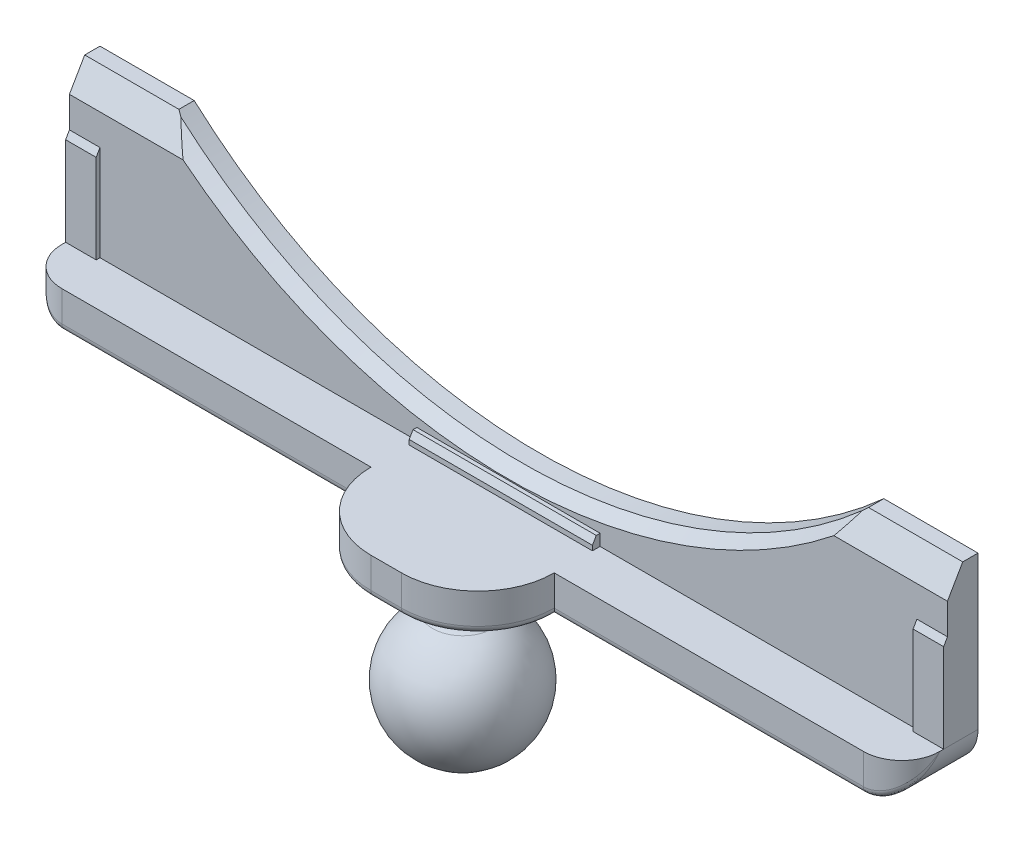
ISO-10303-21;
HEADER;
FILE_DESCRIPTION(('STEP AP214'),'2;1');
FILE_NAME('part.step','',(''),(''),'','','');
FILE_SCHEMA(('AUTOMOTIVE_DESIGN { 1 0 10303 214 1 1 1 1 }'));
ENDSEC;
DATA;
#1=APPLICATION_CONTEXT('core data for automotive mechanical design processes');
#2=APPLICATION_PROTOCOL_DEFINITION('international standard','automotive_design',2000,#1);
#3=PRODUCT_CONTEXT('',#1,'mechanical');
#4=PRODUCT('Part','Part','',(#3));
#5=PRODUCT_RELATED_PRODUCT_CATEGORY('part','',(#4));
#6=PRODUCT_DEFINITION_FORMATION('','',#4);
#7=PRODUCT_DEFINITION_CONTEXT('part definition',#1,'design');
#8=PRODUCT_DEFINITION('design','',#6,#7);
#9=PRODUCT_DEFINITION_SHAPE('','',#8);
#10=(LENGTH_UNIT() NAMED_UNIT(*) SI_UNIT(.MILLI.,.METRE.));
#11=(NAMED_UNIT(*) PLANE_ANGLE_UNIT() SI_UNIT($,.RADIAN.));
#12=(NAMED_UNIT(*) SI_UNIT($,.STERADIAN.) SOLID_ANGLE_UNIT());
#13=UNCERTAINTY_MEASURE_WITH_UNIT(LENGTH_MEASURE(1.E-05),#10,'distance_accuracy_value','');
#14=(GEOMETRIC_REPRESENTATION_CONTEXT(3) GLOBAL_UNCERTAINTY_ASSIGNED_CONTEXT((#13)) GLOBAL_UNIT_ASSIGNED_CONTEXT((#10,
#11,#12)) REPRESENTATION_CONTEXT('',''));
#15=CARTESIAN_POINT('',(0.,0.,0.));
#16=DIRECTION('',(0.,0.,1.));
#17=DIRECTION('',(1.,0.,0.));
#18=AXIS2_PLACEMENT_3D('',#15,#16,#17);
#19=CARTESIAN_POINT('',(0.,0.,4.));
#20=DIRECTION('',(0.,0.,-1.));
#21=DIRECTION('',(-1.,0.,0.));
#22=AXIS2_PLACEMENT_3D('',#19,#20,#21);
#23=PLANE('',#22);
#24=DIRECTION('',(0.,-1.,0.));
#25=VECTOR('',#24,1.);
#26=CARTESIAN_POINT('',(45.5,5.,4.));
#27=LINE('',#26,#25);
#28=CARTESIAN_POINT('',(45.5,6.5,4.));
#29=VERTEX_POINT('',#28);
#30=CARTESIAN_POINT('',(45.5,5.,4.));
#31=VERTEX_POINT('',#30);
#32=EDGE_CURVE('E281',#29,#31,#27,.T.);
#33=ORIENTED_EDGE('',*,*,#32,.F.);
#34=DIRECTION('',(-1.,0.,0.));
#35=VECTOR('',#34,1.);
#36=CARTESIAN_POINT('',(45.5,6.5,4.));
#37=LINE('',#36,#35);
#38=CARTESIAN_POINT('',(69.5,6.5,4.));
#39=VERTEX_POINT('',#38);
#40=EDGE_CURVE('E288',#39,#29,#37,.T.);
#41=ORIENTED_EDGE('',*,*,#40,.F.);
#42=DIRECTION('',(0.,1.,0.));
#43=VECTOR('',#42,1.);
#44=CARTESIAN_POINT('',(69.5,5.,4.));
#45=LINE('',#44,#43);
#46=CARTESIAN_POINT('',(69.5,5.,4.));
#47=VERTEX_POINT('',#46);
#48=EDGE_CURVE('E285',#47,#39,#45,.T.);
#49=ORIENTED_EDGE('',*,*,#48,.F.);
#50=DIRECTION('',(-1.,0.,0.));
#51=VECTOR('',#50,1.);
#52=CARTESIAN_POINT('',(0.,5.,4.));
#53=LINE('',#52,#51);
#54=CARTESIAN_POINT('',(111.,5.,4.));
#55=VERTEX_POINT('',#54);
#56=EDGE_CURVE('E255',#55,#47,#53,.T.);
#57=ORIENTED_EDGE('',*,*,#56,.F.);
#58=DIRECTION('',(0.,-1.,0.));
#59=VECTOR('',#58,1.);
#60=CARTESIAN_POINT('',(111.,5.,4.));
#61=LINE('',#60,#59);
#62=CARTESIAN_POINT('',(111.,17.5,4.));
#63=VERTEX_POINT('',#62);
#64=EDGE_CURVE('E302',#63,#55,#61,.T.);
#65=ORIENTED_EDGE('',*,*,#64,.F.);
#66=DIRECTION('',(-1.,0.,0.));
#67=VECTOR('',#66,1.);
#68=CARTESIAN_POINT('',(115.,17.5,4.));
#69=LINE('',#68,#67);
#70=CARTESIAN_POINT('',(115.,17.5,4.));
#71=VERTEX_POINT('',#70);
#72=EDGE_CURVE('E296',#71,#63,#69,.T.);
#73=ORIENTED_EDGE('',*,*,#72,.F.);
#74=DIRECTION('',(0.,1.,0.));
#75=VECTOR('',#74,1.);
#76=CARTESIAN_POINT('',(115.,0.,4.));
#77=LINE('',#76,#75);
#78=CARTESIAN_POINT('',(115.,21.5358983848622,4.));
#79=VERTEX_POINT('',#78);
#80=EDGE_CURVE('E383',#71,#79,#77,.T.);
#81=ORIENTED_EDGE('',*,*,#80,.T.);
#82=DIRECTION('',(-1.,0.,0.));
#83=VECTOR('',#82,1.);
#84=CARTESIAN_POINT('',(0.,21.5358983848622,4.));
#85=LINE('',#84,#83);
#86=CARTESIAN_POINT('',(100.125075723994,21.5358983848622,4.));
#87=VERTEX_POINT('',#86);
#88=EDGE_CURVE('E432',#79,#87,#85,.T.);
#89=ORIENTED_EDGE('',*,*,#88,.T.);
#90=CARTESIAN_POINT('',(57.5,75.0000454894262,4.));
#91=DIRECTION('',(0.,0.,-1.));
#92=DIRECTION('',(-1.,0.,0.));
#93=AXIS2_PLACEMENT_3D('',#90,#91,#92);
#94=CIRCLE('',#93,68.3762539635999);
#95=CARTESIAN_POINT('',(14.8749242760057,21.5358983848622,4.));
#96=VERTEX_POINT('',#95);
#97=EDGE_CURVE('E460',#87,#96,#94,.T.);
#98=ORIENTED_EDGE('',*,*,#97,.T.);
#99=CARTESIAN_POINT('',(0.,21.5358983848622,4.));
#100=VERTEX_POINT('',#99);
#101=EDGE_CURVE('E431',#96,#100,#85,.T.);
#102=ORIENTED_EDGE('',*,*,#101,.T.);
#103=DIRECTION('',(0.,-1.,0.));
#104=VECTOR('',#103,1.);
#105=CARTESIAN_POINT('',(0.,0.,4.));
#106=LINE('',#105,#104);
#107=CARTESIAN_POINT('',(0.,17.5,4.));
#108=VERTEX_POINT('',#107);
#109=EDGE_CURVE('E379',#100,#108,#106,.T.);
#110=ORIENTED_EDGE('',*,*,#109,.T.);
#111=DIRECTION('',(-1.,0.,0.));
#112=VECTOR('',#111,1.);
#113=CARTESIAN_POINT('',(0.,17.5,4.));
#114=LINE('',#113,#112);
#115=CARTESIAN_POINT('',(4.,17.5,4.));
#116=VERTEX_POINT('',#115);
#117=EDGE_CURVE('E323',#116,#108,#114,.T.);
#118=ORIENTED_EDGE('',*,*,#117,.F.);
#119=DIRECTION('',(0.,1.,0.));
#120=VECTOR('',#119,1.);
#121=CARTESIAN_POINT('',(4.,5.,4.));
#122=LINE('',#121,#120);
#123=CARTESIAN_POINT('',(4.,5.,4.));
#124=VERTEX_POINT('',#123);
#125=EDGE_CURVE('E318',#124,#116,#122,.T.);
#126=ORIENTED_EDGE('',*,*,#125,.F.);
#127=EDGE_CURVE('E356',#31,#124,#53,.T.);
#128=ORIENTED_EDGE('',*,*,#127,.F.);
#129=EDGE_LOOP('',(#33,#41,#49,#57,#65,#73,#81,#89,#98,#102,#110,#118,#126,#128));
#130=FACE_BOUND('',#129,.T.);
#131=ADVANCED_FACE('F45',(#130),#23,.F.);
#132=CARTESIAN_POINT('',(0.,5.,10.));
#133=DIRECTION('',(0.,-1.,0.));
#134=DIRECTION('',(0.,0.,-1.));
#135=AXIS2_PLACEMENT_3D('',#132,#133,#134);
#136=PLANE('',#135);
#137=DIRECTION('',(0.,0.,-1.));
#138=VECTOR('',#137,1.);
#139=CARTESIAN_POINT('',(45.5,5.,5.));
#140=LINE('',#139,#138);
#141=CARTESIAN_POINT('',(45.5,5.,5.));
#142=VERTEX_POINT('',#141);
#143=EDGE_CURVE('E260',#142,#31,#140,.T.);
#144=ORIENTED_EDGE('',*,*,#143,.T.);
#145=ORIENTED_EDGE('',*,*,#127,.T.);
#146=DIRECTION('',(0.,0.,-1.));
#147=VECTOR('',#146,1.);
#148=CARTESIAN_POINT('',(4.,5.,4.5));
#149=LINE('',#148,#147);
#150=CARTESIAN_POINT('',(4.,5.,4.5));
#151=VERTEX_POINT('',#150);
#152=EDGE_CURVE('E330',#151,#124,#149,.T.);
#153=ORIENTED_EDGE('',*,*,#152,.F.);
#154=DIRECTION('',(1.,0.,0.));
#155=VECTOR('',#154,1.);
#156=CARTESIAN_POINT('',(0.,5.,4.5));
#157=LINE('',#156,#155);
#158=CARTESIAN_POINT('',(0.,5.,4.5));
#159=VERTEX_POINT('',#158);
#160=EDGE_CURVE('E322',#159,#151,#157,.T.);
#161=ORIENTED_EDGE('',*,*,#160,.F.);
#162=DIRECTION('',(0.,0.,-1.));
#163=VECTOR('',#162,1.);
#164=CARTESIAN_POINT('',(0.,5.,10.));
#165=LINE('',#164,#163);
#166=CARTESIAN_POINT('',(0.,5.,5.));
#167=VERTEX_POINT('',#166);
#168=EDGE_CURVE('E367',#167,#159,#165,.T.);
#169=ORIENTED_EDGE('',*,*,#168,.F.);
#170=CARTESIAN_POINT('',(5.,5.,5.));
#171=DIRECTION('',(0.,-1.,0.));
#172=DIRECTION('',(0.,0.,-1.));
#173=AXIS2_PLACEMENT_3D('',#170,#171,#172);
#174=CIRCLE('',#173,5.);
#175=CARTESIAN_POINT('',(5.,5.,10.));
#176=VERTEX_POINT('',#175);
#177=EDGE_CURVE('E755',#167,#176,#174,.F.);
#178=ORIENTED_EDGE('',*,*,#177,.T.);
#179=DIRECTION('',(-1.,0.,0.));
#180=VECTOR('',#179,1.);
#181=CARTESIAN_POINT('',(0.,5.,10.));
#182=LINE('',#181,#180);
#183=CARTESIAN_POINT('',(45.5,5.,10.));
#184=VERTEX_POINT('',#183);
#185=EDGE_CURVE('E368',#184,#176,#182,.T.);
#186=ORIENTED_EDGE('',*,*,#185,.F.);
#187=CARTESIAN_POINT('',(55.5,5.,10.));
#188=DIRECTION('',(0.,-1.,0.));
#189=DIRECTION('',(0.,0.,-1.));
#190=AXIS2_PLACEMENT_3D('',#187,#188,#189);
#191=CIRCLE('',#190,10.);
#192=CARTESIAN_POINT('',(55.5,5.,20.));
#193=VERTEX_POINT('',#192);
#194=EDGE_CURVE('E420',#184,#193,#191,.F.);
#195=ORIENTED_EDGE('',*,*,#194,.T.);
#196=DIRECTION('',(-1.,0.,0.));
#197=VECTOR('',#196,1.);
#198=CARTESIAN_POINT('',(45.5,5.,20.));
#199=LINE('',#198,#197);
#200=CARTESIAN_POINT('',(59.5,5.,20.));
#201=VERTEX_POINT('',#200);
#202=EDGE_CURVE('E353',#201,#193,#199,.T.);
#203=ORIENTED_EDGE('',*,*,#202,.F.);
#204=CARTESIAN_POINT('',(59.5,5.,10.));
#205=DIRECTION('',(0.,-1.,0.));
#206=DIRECTION('',(0.,0.,-1.));
#207=AXIS2_PLACEMENT_3D('',#204,#205,#206);
#208=CIRCLE('',#207,10.);
#209=CARTESIAN_POINT('',(69.5,5.,10.));
#210=VERTEX_POINT('',#209);
#211=EDGE_CURVE('E427',#201,#210,#208,.F.);
#212=ORIENTED_EDGE('',*,*,#211,.T.);
#213=CARTESIAN_POINT('',(110.,5.,10.));
#214=VERTEX_POINT('',#213);
#215=EDGE_CURVE('E364',#214,#210,#182,.T.);
#216=ORIENTED_EDGE('',*,*,#215,.F.);
#217=CARTESIAN_POINT('',(110.,5.,5.));
#218=DIRECTION('',(0.,-1.,0.));
#219=DIRECTION('',(0.,0.,-1.));
#220=AXIS2_PLACEMENT_3D('',#217,#218,#219);
#221=CIRCLE('',#220,5.);
#222=CARTESIAN_POINT('',(115.,5.,5.));
#223=VERTEX_POINT('',#222);
#224=EDGE_CURVE('E794',#214,#223,#221,.F.);
#225=ORIENTED_EDGE('',*,*,#224,.T.);
#226=DIRECTION('',(0.,0.,-1.));
#227=VECTOR('',#226,1.);
#228=CARTESIAN_POINT('',(115.,5.,10.));
#229=LINE('',#228,#227);
#230=CARTESIAN_POINT('',(115.,5.,4.5));
#231=VERTEX_POINT('',#230);
#232=EDGE_CURVE('E374',#223,#231,#229,.T.);
#233=ORIENTED_EDGE('',*,*,#232,.T.);
#234=DIRECTION('',(1.,0.,0.));
#235=VECTOR('',#234,1.);
#236=CARTESIAN_POINT('',(115.,5.,4.5));
#237=LINE('',#236,#235);
#238=CARTESIAN_POINT('',(111.,5.,4.5));
#239=VERTEX_POINT('',#238);
#240=EDGE_CURVE('E305',#239,#231,#237,.T.);
#241=ORIENTED_EDGE('',*,*,#240,.F.);
#242=DIRECTION('',(0.,0.,-1.));
#243=VECTOR('',#242,1.);
#244=CARTESIAN_POINT('',(111.,5.,4.5));
#245=LINE('',#244,#243);
#246=EDGE_CURVE('E309',#239,#55,#245,.T.);
#247=ORIENTED_EDGE('',*,*,#246,.T.);
#248=ORIENTED_EDGE('',*,*,#56,.T.);
#249=DIRECTION('',(0.,0.,-1.));
#250=VECTOR('',#249,1.);
#251=CARTESIAN_POINT('',(69.5,5.,5.));
#252=LINE('',#251,#250);
#253=CARTESIAN_POINT('',(69.5,5.,5.));
#254=VERTEX_POINT('',#253);
#255=EDGE_CURVE('E249',#254,#47,#252,.T.);
#256=ORIENTED_EDGE('',*,*,#255,.F.);
#257=DIRECTION('',(1.,0.,0.));
#258=VECTOR('',#257,1.);
#259=CARTESIAN_POINT('',(45.5,5.,5.));
#260=LINE('',#259,#258);
#261=EDGE_CURVE('E252',#142,#254,#260,.T.);
#262=ORIENTED_EDGE('',*,*,#261,.F.);
#263=EDGE_LOOP('',(#144,#145,#153,#161,#169,#178,#186,#195,#203,#212,#216,#225,#233,#241,#247,
#248,#256,#262));
#264=FACE_BOUND('',#263,.T.);
#265=ADVANCED_FACE('F251',(#264),#136,.F.);
#266=CARTESIAN_POINT('',(0.,25.,4.));
#267=DIRECTION('',(0.,-1.,0.));
#268=DIRECTION('',(0.,0.,-1.));
#269=AXIS2_PLACEMENT_3D('',#266,#267,#268);
#270=PLANE('',#269);
#271=DIRECTION('',(-1.,0.,0.));
#272=VECTOR('',#271,1.);
#273=CARTESIAN_POINT('',(0.,25.,0.));
#274=LINE('',#273,#272);
#275=CARTESIAN_POINT('',(115.,25.,0.));
#276=VERTEX_POINT('',#275);
#277=CARTESIAN_POINT('',(102.661433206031,25.,0.));
#278=VERTEX_POINT('',#277);
#279=EDGE_CURVE('E384',#276,#278,#274,.T.);
#280=ORIENTED_EDGE('',*,*,#279,.T.);
#281=DIRECTION('',(0.,0.,1.));
#282=VECTOR('',#281,1.);
#283=CARTESIAN_POINT('',(102.661433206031,25.,-6.));
#284=LINE('',#283,#282);
#285=CARTESIAN_POINT('',(102.661433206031,25.,2.));
#286=VERTEX_POINT('',#285);
#287=EDGE_CURVE('E348',#278,#286,#284,.T.);
#288=ORIENTED_EDGE('',*,*,#287,.T.);
#289=DIRECTION('',(1.,0.,0.));
#290=VECTOR('',#289,1.);
#291=CARTESIAN_POINT('',(0.,25.,2.));
#292=LINE('',#291,#290);
#293=CARTESIAN_POINT('',(115.,25.,2.));
#294=VERTEX_POINT('',#293);
#295=EDGE_CURVE('E439',#286,#294,#292,.T.);
#296=ORIENTED_EDGE('',*,*,#295,.T.);
#297=DIRECTION('',(0.,0.,-1.));
#298=VECTOR('',#297,1.);
#299=CARTESIAN_POINT('',(115.,25.,4.));
#300=LINE('',#299,#298);
#301=EDGE_CURVE('E404',#294,#276,#300,.T.);
#302=ORIENTED_EDGE('',*,*,#301,.T.);
#303=EDGE_LOOP('',(#280,#288,#296,#302));
#304=FACE_BOUND('',#303,.T.);
#305=ADVANCED_FACE('F546',(#304),#270,.F.);
#306=CARTESIAN_POINT('',(0.,21.5358983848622,4.));
#307=DIRECTION('',(0.,-0.5,-0.866025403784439));
#308=DIRECTION('',(-1.,0.,0.));
#309=AXIS2_PLACEMENT_3D('',#306,#307,#308);
#310=PLANE('',#309);
#311=CARTESIAN_POINT('',(57.5,75.0000454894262,-26.8675397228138));
#312=DIRECTION('',(0.,-0.5,-0.866025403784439));
#313=DIRECTION('',(0.,-0.866025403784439,0.5));
#314=AXIS2_PLACEMENT_3D('',#311,#312,#313);
#315=ELLIPSE('',#314,77.799396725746,67.3762539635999);
#316=CARTESIAN_POINT('',(102.142238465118,24.5358983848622,2.26794919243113));
#317=VERTEX_POINT('',#316);
#318=EDGE_CURVE('E452',#317,#286,#315,.F.);
#319=ORIENTED_EDGE('',*,*,#318,.F.);
#320=CARTESIAN_POINT('',(57.5,56.041968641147,-15.9220889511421));
#321=DIRECTION('',(0.,-0.5,-0.866025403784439));
#322=DIRECTION('',(0.,-0.866025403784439,0.5));
#323=AXIS2_PLACEMENT_3D('',#320,#321,#322);
#324=ELLIPSE('',#323,65.6727046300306,53.6215387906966);
#325=EDGE_CURVE('E457',#317,#87,#324,.T.);
#326=ORIENTED_EDGE('',*,*,#325,.T.);
#327=ORIENTED_EDGE('',*,*,#88,.F.);
#328=DIRECTION('',(0.,0.866025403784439,-0.5));
#329=VECTOR('',#328,1.);
#330=CARTESIAN_POINT('',(115.,21.5358983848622,4.));
#331=LINE('',#330,#329);
#332=EDGE_CURVE('E444',#294,#79,#331,.F.);
#333=ORIENTED_EDGE('',*,*,#332,.F.);
#334=ORIENTED_EDGE('',*,*,#295,.F.);
#335=EDGE_LOOP('',(#319,#326,#327,#333,#334));
#336=FACE_BOUND('',#335,.T.);
#337=ADVANCED_FACE('F596',(#336),#310,.F.);
#338=CARTESIAN_POINT('',(0.,0.,10.));
#339=DIRECTION('',(0.,0.,-1.));
#340=DIRECTION('',(-1.,0.,0.));
#341=AXIS2_PLACEMENT_3D('',#338,#339,#340);
#342=PLANE('',#341);
#343=ORIENTED_EDGE('',*,*,#185,.T.);
#344=DIRECTION('',(0.,-1.,0.));
#345=VECTOR('',#344,1.);
#346=CARTESIAN_POINT('',(5.,0.,10.));
#347=LINE('',#346,#345);
#348=CARTESIAN_POINT('',(5.,1.,10.));
#349=VERTEX_POINT('',#348);
#350=EDGE_CURVE('E758',#176,#349,#347,.T.);
#351=ORIENTED_EDGE('',*,*,#350,.T.);
#352=DIRECTION('',(1.,0.,0.));
#353=VECTOR('',#352,1.);
#354=CARTESIAN_POINT('',(0.,1.,10.));
#355=LINE('',#354,#353);
#356=CARTESIAN_POINT('',(45.5,1.,10.));
#357=VERTEX_POINT('',#356);
#358=EDGE_CURVE('E473',#349,#357,#355,.T.);
#359=ORIENTED_EDGE('',*,*,#358,.T.);
#360=DIRECTION('',(0.,-1.,0.));
#361=VECTOR('',#360,1.);
#362=CARTESIAN_POINT('',(45.5,0.,10.));
#363=LINE('',#362,#361);
#364=EDGE_CURVE('E352',#184,#357,#363,.T.);
#365=ORIENTED_EDGE('',*,*,#364,.F.);
#366=EDGE_LOOP('',(#343,#351,#359,#365));
#367=FACE_BOUND('',#366,.T.);
#368=ADVANCED_FACE('F604',(#367),#342,.F.);
#369=DIRECTION('',(1.,0.,0.));
#370=VECTOR('',#369,1.);
#371=CARTESIAN_POINT('',(0.,1.,10.));
#372=LINE('',#371,#370);
#373=CARTESIAN_POINT('',(69.5,1.,10.));
#374=VERTEX_POINT('',#373);
#375=CARTESIAN_POINT('',(110.,1.,10.));
#376=VERTEX_POINT('',#375);
#377=EDGE_CURVE('E466',#374,#376,#372,.T.);
#378=ORIENTED_EDGE('',*,*,#377,.T.);
#379=DIRECTION('',(0.,1.,0.));
#380=VECTOR('',#379,1.);
#381=CARTESIAN_POINT('',(110.,0.,10.));
#382=LINE('',#381,#380);
#383=EDGE_CURVE('E1154',#376,#214,#382,.T.);
#384=ORIENTED_EDGE('',*,*,#383,.T.);
#385=ORIENTED_EDGE('',*,*,#215,.T.);
#386=DIRECTION('',(0.,1.,0.));
#387=VECTOR('',#386,1.);
#388=CARTESIAN_POINT('',(69.5,0.,10.));
#389=LINE('',#388,#387);
#390=EDGE_CURVE('E357',#374,#210,#389,.T.);
#391=ORIENTED_EDGE('',*,*,#390,.F.);
#392=EDGE_LOOP('',(#378,#384,#385,#391));
#393=FACE_BOUND('',#392,.T.);
#394=ADVANCED_FACE('F571',(#393),#342,.F.);
#395=CARTESIAN_POINT('',(0.,0.,4.));
#396=DIRECTION('',(1.,0.,0.));
#397=DIRECTION('',(0.,0.,-1.));
#398=AXIS2_PLACEMENT_3D('',#395,#396,#397);
#399=PLANE('',#398);
#400=DIRECTION('',(0.,-1.,0.));
#401=VECTOR('',#400,1.);
#402=CARTESIAN_POINT('',(0.,5.,4.5));
#403=LINE('',#402,#401);
#404=CARTESIAN_POINT('',(0.,16.6339745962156,4.5));
#405=VERTEX_POINT('',#404);
#406=EDGE_CURVE('E319',#405,#159,#403,.T.);
#407=ORIENTED_EDGE('',*,*,#406,.F.);
#408=DIRECTION('',(0.,-0.866025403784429,0.500000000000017));
#409=VECTOR('',#408,1.);
#410=CARTESIAN_POINT('',(0.,16.6339745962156,4.5));
#411=LINE('',#410,#409);
#412=EDGE_CURVE('E724',#405,#108,#411,.F.);
#413=ORIENTED_EDGE('',*,*,#412,.T.);
#414=ORIENTED_EDGE('',*,*,#109,.F.);
#415=DIRECTION('',(0.,-0.866025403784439,0.5));
#416=VECTOR('',#415,1.);
#417=CARTESIAN_POINT('',(0.,21.5358983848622,4.));
#418=LINE('',#417,#416);
#419=CARTESIAN_POINT('',(0.,25.,2.));
#420=VERTEX_POINT('',#419);
#421=EDGE_CURVE('E436',#100,#420,#418,.F.);
#422=ORIENTED_EDGE('',*,*,#421,.T.);
#423=DIRECTION('',(0.,0.,-1.));
#424=VECTOR('',#423,1.);
#425=CARTESIAN_POINT('',(0.,25.,4.));
#426=LINE('',#425,#424);
#427=CARTESIAN_POINT('',(0.,25.,0.));
#428=VERTEX_POINT('',#427);
#429=EDGE_CURVE('E387',#420,#428,#426,.T.);
#430=ORIENTED_EDGE('',*,*,#429,.T.);
#431=DIRECTION('',(0.,-1.,0.));
#432=VECTOR('',#431,1.);
#433=CARTESIAN_POINT('',(0.,0.,0.));
#434=LINE('',#433,#432);
#435=CARTESIAN_POINT('',(0.,5.,0.));
#436=VERTEX_POINT('',#435);
#437=EDGE_CURVE('E378',#428,#436,#434,.T.);
#438=ORIENTED_EDGE('',*,*,#437,.T.);
#439=DIRECTION('',(0.,0.,-1.));
#440=VECTOR('',#439,1.);
#441=CARTESIAN_POINT('',(0.,5.,4.));
#442=LINE('',#441,#440);
#443=EDGE_CURVE('E648',#436,#159,#442,.F.);
#444=ORIENTED_EDGE('',*,*,#443,.T.);
#445=EDGE_LOOP('',(#407,#413,#414,#422,#430,#438,#444));
#446=FACE_BOUND('',#445,.T.);
#447=ADVANCED_FACE('F567',(#446),#399,.F.);
#448=CARTESIAN_POINT('',(0.,0.,4.));
#449=DIRECTION('',(0.,1.,0.));
#450=DIRECTION('',(0.,0.,1.));
#451=AXIS2_PLACEMENT_3D('',#448,#449,#450);
#452=PLANE('',#451);
#453=CARTESIAN_POINT('',(57.5,0.,10.));
#454=DIRECTION('',(0.,1.,0.));
#455=DIRECTION('',(0.,0.,1.));
#456=AXIS2_PLACEMENT_3D('',#453,#454,#455);
#457=CIRCLE('',#456,5.1);
#458=CARTESIAN_POINT('',(57.5,0.,15.1));
#459=VERTEX_POINT('',#458);
#460=EDGE_CURVE('E730',#459,#459,#457,.T.);
#461=ORIENTED_EDGE('',*,*,#460,.T.);
#462=EDGE_LOOP('',(#461));
#463=FACE_BOUND('',#462,.T.);
#464=DIRECTION('',(1.,0.,0.));
#465=VECTOR('',#464,1.);
#466=CARTESIAN_POINT('',(0.,0.,9.));
#467=LINE('',#466,#465);
#468=CARTESIAN_POINT('',(46.5557280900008,0.,9.));
#469=VERTEX_POINT('',#468);
#470=CARTESIAN_POINT('',(5.,0.,9.));
#471=VERTEX_POINT('',#470);
#472=EDGE_CURVE('E476',#469,#471,#467,.F.);
#473=ORIENTED_EDGE('',*,*,#472,.T.);
#474=DIRECTION('',(0.,0.,-1.));
#475=VECTOR('',#474,1.);
#476=CARTESIAN_POINT('',(5.,0.,4.));
#477=LINE('',#476,#475);
#478=CARTESIAN_POINT('',(5.,0.,0.));
#479=VERTEX_POINT('',#478);
#480=EDGE_CURVE('E745',#471,#479,#477,.T.);
#481=ORIENTED_EDGE('',*,*,#480,.T.);
#482=DIRECTION('',(1.,0.,0.));
#483=VECTOR('',#482,1.);
#484=CARTESIAN_POINT('',(0.,0.,0.));
#485=LINE('',#484,#483);
#486=CARTESIAN_POINT('',(110.,0.,0.));
#487=VERTEX_POINT('',#486);
#488=EDGE_CURVE('E391',#479,#487,#485,.T.);
#489=ORIENTED_EDGE('',*,*,#488,.T.);
#490=DIRECTION('',(0.,0.,-1.));
#491=VECTOR('',#490,1.);
#492=CARTESIAN_POINT('',(110.,0.,4.));
#493=LINE('',#492,#491);
#494=CARTESIAN_POINT('',(110.,0.,9.));
#495=VERTEX_POINT('',#494);
#496=EDGE_CURVE('E762',#487,#495,#493,.F.);
#497=ORIENTED_EDGE('',*,*,#496,.T.);
#498=DIRECTION('',(1.,0.,0.));
#499=VECTOR('',#498,1.);
#500=CARTESIAN_POINT('',(0.,0.,9.));
#501=LINE('',#500,#499);
#502=CARTESIAN_POINT('',(68.4442719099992,0.,9.));
#503=VERTEX_POINT('',#502);
#504=EDGE_CURVE('E470',#495,#503,#501,.F.);
#505=ORIENTED_EDGE('',*,*,#504,.T.);
#506=CARTESIAN_POINT('',(59.5,0.,10.));
#507=DIRECTION('',(0.,1.,0.));
#508=DIRECTION('',(0.,0.,1.));
#509=AXIS2_PLACEMENT_3D('',#506,#507,#508);
#510=CIRCLE('',#509,9.);
#511=CARTESIAN_POINT('',(59.5,0.,19.));
#512=VERTEX_POINT('',#511);
#513=EDGE_CURVE('E487',#503,#512,#510,.F.);
#514=ORIENTED_EDGE('',*,*,#513,.T.);
#515=DIRECTION('',(1.,0.,0.));
#516=VECTOR('',#515,1.);
#517=CARTESIAN_POINT('',(0.,0.,19.));
#518=LINE('',#517,#516);
#519=CARTESIAN_POINT('',(55.5,0.,19.));
#520=VERTEX_POINT('',#519);
#521=EDGE_CURVE('E484',#512,#520,#518,.F.);
#522=ORIENTED_EDGE('',*,*,#521,.T.);
#523=CARTESIAN_POINT('',(55.5,0.,10.));
#524=DIRECTION('',(0.,1.,0.));
#525=DIRECTION('',(0.,0.,1.));
#526=AXIS2_PLACEMENT_3D('',#523,#524,#525);
#527=CIRCLE('',#526,9.);
#528=EDGE_CURVE('E480',#520,#469,#527,.F.);
#529=ORIENTED_EDGE('',*,*,#528,.T.);
#530=EDGE_LOOP('',(#473,#481,#489,#497,#505,#514,#522,#529));
#531=FACE_BOUND('',#530,.T.);
#532=ADVANCED_FACE('F563',(#463,#531),#452,.F.);
#533=CARTESIAN_POINT('',(115.,0.,4.));
#534=DIRECTION('',(-1.,0.,0.));
#535=DIRECTION('',(0.,0.,1.));
#536=AXIS2_PLACEMENT_3D('',#533,#534,#535);
#537=PLANE('',#536);
#538=ORIENTED_EDGE('',*,*,#80,.F.);
#539=DIRECTION('',(0.,-0.866025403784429,0.500000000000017));
#540=VECTOR('',#539,1.);
#541=CARTESIAN_POINT('',(115.,16.6339745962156,4.5));
#542=LINE('',#541,#540);
#543=CARTESIAN_POINT('',(115.,16.6339745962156,4.5));
#544=VERTEX_POINT('',#543);
#545=EDGE_CURVE('E702',#71,#544,#542,.T.);
#546=ORIENTED_EDGE('',*,*,#545,.T.);
#547=DIRECTION('',(0.,1.,0.));
#548=VECTOR('',#547,1.);
#549=CARTESIAN_POINT('',(115.,5.,4.5));
#550=LINE('',#549,#548);
#551=EDGE_CURVE('E297',#231,#544,#550,.T.);
#552=ORIENTED_EDGE('',*,*,#551,.F.);
#553=DIRECTION('',(0.,0.,-1.));
#554=VECTOR('',#553,1.);
#555=CARTESIAN_POINT('',(115.,5.,4.));
#556=LINE('',#555,#554);
#557=CARTESIAN_POINT('',(115.,5.,0.));
#558=VERTEX_POINT('',#557);
#559=EDGE_CURVE('E782',#231,#558,#556,.T.);
#560=ORIENTED_EDGE('',*,*,#559,.T.);
#561=DIRECTION('',(0.,1.,0.));
#562=VECTOR('',#561,1.);
#563=CARTESIAN_POINT('',(115.,0.,0.));
#564=LINE('',#563,#562);
#565=EDGE_CURVE('E394',#558,#276,#564,.T.);
#566=ORIENTED_EDGE('',*,*,#565,.T.);
#567=ORIENTED_EDGE('',*,*,#301,.F.);
#568=ORIENTED_EDGE('',*,*,#332,.T.);
#569=EDGE_LOOP('',(#538,#546,#552,#560,#566,#567,#568));
#570=FACE_BOUND('',#569,.T.);
#571=ADVANCED_FACE('F559',(#570),#537,.F.);
#572=CARTESIAN_POINT('',(12.3385667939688,25.,2.));
#573=VERTEX_POINT('',#572);
#574=EDGE_CURVE('E440',#420,#573,#292,.T.);
#575=ORIENTED_EDGE('',*,*,#574,.T.);
#576=DIRECTION('',(0.,0.,1.));
#577=VECTOR('',#576,1.);
#578=CARTESIAN_POINT('',(12.3385667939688,25.,-6.));
#579=LINE('',#578,#577);
#580=CARTESIAN_POINT('',(12.3385667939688,25.,0.));
#581=VERTEX_POINT('',#580);
#582=EDGE_CURVE('E340',#573,#581,#579,.F.);
#583=ORIENTED_EDGE('',*,*,#582,.T.);
#584=EDGE_CURVE('E397',#581,#428,#274,.T.);
#585=ORIENTED_EDGE('',*,*,#584,.T.);
#586=ORIENTED_EDGE('',*,*,#429,.F.);
#587=EDGE_LOOP('',(#575,#583,#585,#586));
#588=FACE_BOUND('',#587,.T.);
#589=ADVANCED_FACE('F555',(#588),#270,.F.);
#590=CARTESIAN_POINT('',(0.,0.,0.));
#591=DIRECTION('',(0.,0.,-1.));
#592=DIRECTION('',(-1.,0.,0.));
#593=AXIS2_PLACEMENT_3D('',#590,#591,#592);
#594=PLANE('',#593);
#595=ORIENTED_EDGE('',*,*,#488,.F.);
#596=CARTESIAN_POINT('',(5.,5.,0.));
#597=DIRECTION('',(0.,0.,-1.));
#598=DIRECTION('',(-1.,0.,0.));
#599=AXIS2_PLACEMENT_3D('',#596,#597,#598);
#600=CIRCLE('',#599,5.);
#601=EDGE_CURVE('E740',#479,#436,#600,.T.);
#602=ORIENTED_EDGE('',*,*,#601,.T.);
#603=ORIENTED_EDGE('',*,*,#437,.F.);
#604=ORIENTED_EDGE('',*,*,#584,.F.);
#605=CARTESIAN_POINT('',(57.5,75.0000454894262,0.));
#606=DIRECTION('',(0.,0.,-1.));
#607=DIRECTION('',(-1.,0.,0.));
#608=AXIS2_PLACEMENT_3D('',#605,#606,#607);
#609=CIRCLE('',#608,67.3762539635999);
#610=EDGE_CURVE('E344',#278,#581,#609,.T.);
#611=ORIENTED_EDGE('',*,*,#610,.F.);
#612=ORIENTED_EDGE('',*,*,#279,.F.);
#613=ORIENTED_EDGE('',*,*,#565,.F.);
#614=CARTESIAN_POINT('',(110.,5.,0.));
#615=DIRECTION('',(0.,0.,-1.));
#616=DIRECTION('',(-1.,0.,0.));
#617=AXIS2_PLACEMENT_3D('',#614,#615,#616);
#618=CIRCLE('',#617,5.);
#619=EDGE_CURVE('E786',#558,#487,#618,.T.);
#620=ORIENTED_EDGE('',*,*,#619,.T.);
#621=EDGE_LOOP('',(#595,#602,#603,#604,#611,#612,#613,#620));
#622=FACE_BOUND('',#621,.T.);
#623=ADVANCED_FACE('F551',(#622),#594,.T.);
#624=CARTESIAN_POINT('',(57.5,-5.,10.));
#625=DIRECTION('',(0.,1.,0.));
#626=DIRECTION('',(0.,0.,1.));
#627=AXIS2_PLACEMENT_3D('',#624,#625,#626);
#628=CYLINDRICAL_SURFACE('',#627,3.1);
#629=CARTESIAN_POINT('',(57.5,-2.,10.));
#630=DIRECTION('',(0.,1.,0.));
#631=DIRECTION('',(0.,0.,1.));
#632=AXIS2_PLACEMENT_3D('',#629,#630,#631);
#633=CIRCLE('',#632,3.1);
#634=CARTESIAN_POINT('',(57.5,-2.,13.1));
#635=VERTEX_POINT('',#634);
#636=EDGE_CURVE('E653',#635,#635,#633,.F.);
#637=ORIENTED_EDGE('',*,*,#636,.T.);
#638=EDGE_LOOP('',(#637));
#639=FACE_BOUND('',#638,.T.);
#640=CARTESIAN_POINT('',(57.5,-4.02703539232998,10.));
#641=DIRECTION('',(0.,-1.,0.));
#642=DIRECTION('',(0.,0.,-1.));
#643=AXIS2_PLACEMENT_3D('',#640,#641,#642);
#644=CIRCLE('',#643,3.1);
#645=CARTESIAN_POINT('',(57.5,-4.02703539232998,6.9));
#646=VERTEX_POINT('',#645);
#647=EDGE_CURVE('E412',#646,#646,#644,.F.);
#648=ORIENTED_EDGE('',*,*,#647,.T.);
#649=EDGE_LOOP('',(#648));
#650=FACE_BOUND('',#649,.T.);
#651=ADVANCED_FACE('F554',(#639,#650),#628,.T.);
#652=CARTESIAN_POINT('',(57.5,-13.0881343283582,10.));
#653=DIRECTION('',(0.,0.,1.));
#654=DIRECTION('',(1.,0.,0.));
#655=AXIS2_PLACEMENT_3D('',#652,#653,#654);
#656=SPHERICAL_SURFACE('',#655,8.66186567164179);
#657=CARTESIAN_POINT('',(57.5,-13.0881343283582,10.));
#658=DIRECTION('',(0.,-1.,0.));
#659=DIRECTION('',(0.,0.,-1.));
#660=AXIS2_PLACEMENT_3D('',#657,#658,#659);
#661=SPHERICAL_SURFACE('',#660,8.66186567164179);
#662=CARTESIAN_POINT('',(57.5,-5.3645504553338,10.));
#663=DIRECTION('',(0.,-1.,0.));
#664=DIRECTION('',(0.,0.,-1.));
#665=AXIS2_PLACEMENT_3D('',#662,#663,#664);
#666=CIRCLE('',#665,3.92099082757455);
#667=CARTESIAN_POINT('',(57.5,-5.3645504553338,6.07900917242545));
#668=VERTEX_POINT('',#667);
#669=EDGE_CURVE('E408',#668,#668,#666,.T.);
#670=ORIENTED_EDGE('',*,*,#669,.T.);
#671=EDGE_LOOP('',(#670));
#672=FACE_BOUND('',#671,.T.);
#673=ADVANCED_FACE('F573',(#672),#661,.T.);
#674=CARTESIAN_POINT('',(57.5,-4.02703539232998,10.));
#675=DIRECTION('',(0.,-1.,0.));
#676=DIRECTION('',(0.,0.,-1.));
#677=AXIS2_PLACEMENT_3D('',#674,#675,#676);
#678=TOROIDAL_SURFACE('',#677,4.59999999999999,1.5);
#679=ORIENTED_EDGE('',*,*,#647,.F.);
#680=EDGE_LOOP('',(#679));
#681=FACE_BOUND('',#680,.T.);
#682=ORIENTED_EDGE('',*,*,#669,.F.);
#683=EDGE_LOOP('',(#682));
#684=FACE_BOUND('',#683,.T.);
#685=ADVANCED_FACE('F576',(#681,#684),#678,.F.);
#686=CARTESIAN_POINT('',(0.,0.,20.));
#687=DIRECTION('',(0.,0.,-1.));
#688=DIRECTION('',(-1.,0.,0.));
#689=AXIS2_PLACEMENT_3D('',#686,#687,#688);
#690=PLANE('',#689);
#691=DIRECTION('',(0.,-1.,0.));
#692=VECTOR('',#691,1.);
#693=CARTESIAN_POINT('',(55.5,0.,20.));
#694=LINE('',#693,#692);
#695=CARTESIAN_POINT('',(55.5,1.,20.));
#696=VERTEX_POINT('',#695);
#697=EDGE_CURVE('E416',#193,#696,#694,.T.);
#698=ORIENTED_EDGE('',*,*,#697,.T.);
#699=DIRECTION('',(1.,0.,0.));
#700=VECTOR('',#699,1.);
#701=CARTESIAN_POINT('',(0.,1.,20.));
#702=LINE('',#701,#700);
#703=CARTESIAN_POINT('',(59.5,1.,20.));
#704=VERTEX_POINT('',#703);
#705=EDGE_CURVE('E494',#696,#704,#702,.T.);
#706=ORIENTED_EDGE('',*,*,#705,.T.);
#707=DIRECTION('',(0.,1.,0.));
#708=VECTOR('',#707,1.);
#709=CARTESIAN_POINT('',(59.5,0.,20.));
#710=LINE('',#709,#708);
#711=EDGE_CURVE('E424',#704,#201,#710,.T.);
#712=ORIENTED_EDGE('',*,*,#711,.T.);
#713=ORIENTED_EDGE('',*,*,#202,.T.);
#714=EDGE_LOOP('',(#698,#706,#712,#713));
#715=FACE_BOUND('',#714,.T.);
#716=ADVANCED_FACE('F580',(#715),#690,.F.);
#717=CARTESIAN_POINT('',(55.5,0.,10.));
#718=DIRECTION('',(0.,-1.,0.));
#719=DIRECTION('',(0.,0.,-1.));
#720=AXIS2_PLACEMENT_3D('',#717,#718,#719);
#721=CYLINDRICAL_SURFACE('',#720,10.);
#722=ORIENTED_EDGE('',*,*,#364,.T.);
#723=CARTESIAN_POINT('',(55.5,1.,10.));
#724=DIRECTION('',(0.,1.,0.));
#725=DIRECTION('',(0.,0.,1.));
#726=AXIS2_PLACEMENT_3D('',#723,#724,#725);
#727=CIRCLE('',#726,10.);
#728=EDGE_CURVE('E497',#357,#696,#727,.T.);
#729=ORIENTED_EDGE('',*,*,#728,.T.);
#730=ORIENTED_EDGE('',*,*,#697,.F.);
#731=ORIENTED_EDGE('',*,*,#194,.F.);
#732=EDGE_LOOP('',(#722,#729,#730,#731));
#733=FACE_BOUND('',#732,.T.);
#734=ADVANCED_FACE('F582',(#733),#721,.T.);
#735=CARTESIAN_POINT('',(59.5,0.,10.));
#736=DIRECTION('',(0.,1.,0.));
#737=DIRECTION('',(0.,0.,1.));
#738=AXIS2_PLACEMENT_3D('',#735,#736,#737);
#739=CYLINDRICAL_SURFACE('',#738,10.);
#740=ORIENTED_EDGE('',*,*,#711,.F.);
#741=CARTESIAN_POINT('',(59.5,1.,10.));
#742=DIRECTION('',(0.,1.,0.));
#743=DIRECTION('',(0.,0.,1.));
#744=AXIS2_PLACEMENT_3D('',#741,#742,#743);
#745=CIRCLE('',#744,10.);
#746=EDGE_CURVE('E491',#704,#374,#745,.T.);
#747=ORIENTED_EDGE('',*,*,#746,.T.);
#748=ORIENTED_EDGE('',*,*,#390,.T.);
#749=ORIENTED_EDGE('',*,*,#211,.F.);
#750=EDGE_LOOP('',(#740,#747,#748,#749));
#751=FACE_BOUND('',#750,.T.);
#752=ADVANCED_FACE('F585',(#751),#739,.T.);
#753=ORIENTED_EDGE('',*,*,#101,.F.);
#754=CARTESIAN_POINT('',(57.5,56.041968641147,-15.9220889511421));
#755=DIRECTION('',(0.,-0.5,-0.866025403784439));
#756=DIRECTION('',(0.,-0.866025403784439,0.5));
#757=AXIS2_PLACEMENT_3D('',#754,#755,#756);
#758=ELLIPSE('',#757,65.6727046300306,53.6215387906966);
#759=CARTESIAN_POINT('',(12.8577615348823,24.5358983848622,2.26794919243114));
#760=VERTEX_POINT('',#759);
#761=EDGE_CURVE('E463',#96,#760,#758,.T.);
#762=ORIENTED_EDGE('',*,*,#761,.T.);
#763=EDGE_CURVE('E448',#573,#760,#315,.F.);
#764=ORIENTED_EDGE('',*,*,#763,.F.);
#765=ORIENTED_EDGE('',*,*,#574,.F.);
#766=ORIENTED_EDGE('',*,*,#421,.F.);
#767=EDGE_LOOP('',(#753,#762,#764,#765,#766));
#768=FACE_BOUND('',#767,.T.);
#769=ADVANCED_FACE('F588',(#768),#310,.F.);
#770=CARTESIAN_POINT('',(57.5,75.0000454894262,-6.));
#771=DIRECTION('',(0.,0.,1.));
#772=DIRECTION('',(1.,0.,0.));
#773=AXIS2_PLACEMENT_3D('',#770,#771,#772);
#774=CYLINDRICAL_SURFACE('',#773,67.3762539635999);
#775=ORIENTED_EDGE('',*,*,#763,.T.);
#776=CARTESIAN_POINT('',(57.5,75.0000454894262,2.26794919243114));
#777=DIRECTION('',(0.,0.,-1.));
#778=DIRECTION('',(-1.,0.,0.));
#779=AXIS2_PLACEMENT_3D('',#776,#777,#778);
#780=CIRCLE('',#779,67.3762539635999);
#781=EDGE_CURVE('E453',#760,#317,#780,.F.);
#782=ORIENTED_EDGE('',*,*,#781,.T.);
#783=ORIENTED_EDGE('',*,*,#318,.T.);
#784=ORIENTED_EDGE('',*,*,#287,.F.);
#785=ORIENTED_EDGE('',*,*,#610,.T.);
#786=ORIENTED_EDGE('',*,*,#582,.F.);
#787=EDGE_LOOP('',(#775,#782,#783,#784,#785,#786));
#788=FACE_BOUND('',#787,.T.);
#789=ADVANCED_FACE('F594',(#788),#774,.F.);
#790=CARTESIAN_POINT('',(57.5,75.0000454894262,2.26794919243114));
#791=DIRECTION('',(0.,0.,1.));
#792=DIRECTION('',(1.,0.,0.));
#793=AXIS2_PLACEMENT_3D('',#790,#791,#792);
#794=CONICAL_SURFACE('',#793,67.3762539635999,0.523598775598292);
#795=ORIENTED_EDGE('',*,*,#761,.F.);
#796=ORIENTED_EDGE('',*,*,#97,.F.);
#797=ORIENTED_EDGE('',*,*,#325,.F.);
#798=ORIENTED_EDGE('',*,*,#781,.F.);
#799=EDGE_LOOP('',(#795,#796,#797,#798));
#800=FACE_BOUND('',#799,.T.);
#801=ADVANCED_FACE('F526',(#800),#794,.F.);
#802=CARTESIAN_POINT('',(0.,1.,9.));
#803=DIRECTION('',(1.,0.,0.));
#804=DIRECTION('',(0.,0.,-1.));
#805=AXIS2_PLACEMENT_3D('',#802,#803,#804);
#806=CYLINDRICAL_SURFACE('',#805,1.);
#807=ORIENTED_EDGE('',*,*,#504,.F.);
#808=CARTESIAN_POINT('',(110.,1.,9.));
#809=DIRECTION('',(-1.,0.,0.));
#810=DIRECTION('',(0.,0.,1.));
#811=AXIS2_PLACEMENT_3D('',#808,#809,#810);
#812=CIRCLE('',#811,1.);
#813=EDGE_CURVE('E789',#495,#376,#812,.T.);
#814=ORIENTED_EDGE('',*,*,#813,.T.);
#815=ORIENTED_EDGE('',*,*,#377,.F.);
#816=CARTESIAN_POINT('',(69.5,1.,10.));
#817=CARTESIAN_POINT('',(69.5000026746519,0.97766632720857,10.0000029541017));
#818=CARTESIAN_POINT('',(69.4992511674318,0.955346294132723,9.99925114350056));
#819=CARTESIAN_POINT('',(69.4962721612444,0.910920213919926,9.99627268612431));
#820=CARTESIAN_POINT('',(69.4940457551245,0.888814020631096,9.99404713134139));
#821=CARTESIAN_POINT('',(69.4852548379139,0.823446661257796,9.98526392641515));
#822=CARTESIAN_POINT('',(69.4765772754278,0.780722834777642,9.97659830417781));
#823=CARTESIAN_POINT('',(69.4542181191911,0.698156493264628,9.95431682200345));
#824=CARTESIAN_POINT('',(69.4405494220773,0.658306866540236,9.94071372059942));
#825=CARTESIAN_POINT('',(69.4089792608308,0.581989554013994,9.9093810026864));
#826=CARTESIAN_POINT('',(69.391068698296,0.545529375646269,9.89164251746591));
#827=CARTESIAN_POINT('',(69.3440409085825,0.462727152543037,9.84521983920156));
#828=CARTESIAN_POINT('',(69.313293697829,0.418184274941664,9.81498198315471));
#829=CARTESIAN_POINT('',(69.2469373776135,0.33659748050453,9.75008400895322));
#830=CARTESIAN_POINT('',(69.2113193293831,0.299567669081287,9.71541576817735));
#831=CARTESIAN_POINT('',(69.1214184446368,0.219070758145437,9.62844745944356));
#832=CARTESIAN_POINT('',(69.0654260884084,0.179087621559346,9.5747006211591));
#833=CARTESIAN_POINT('',(68.9491003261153,0.111853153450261,9.4641047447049));
#834=CARTESIAN_POINT('',(68.8887605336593,0.0846210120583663,9.40725117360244));
#835=CARTESIAN_POINT('',(68.7659180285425,0.0418517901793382,9.29267462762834));
#836=CARTESIAN_POINT('',(68.7034370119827,0.0262209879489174,9.23496254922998));
#837=CARTESIAN_POINT('',(68.5770533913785,0.00543076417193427,9.11944568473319));
#838=CARTESIAN_POINT('',(68.5131537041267,0.000251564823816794,9.06164128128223));
#839=CARTESIAN_POINT('',(68.4474241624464,2.98715891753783E-06,9.00281983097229));
#840=CARTESIAN_POINT('',(68.4458481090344,6.17750430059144E-09,9.0014097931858));
#841=CARTESIAN_POINT('',(68.4442719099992,0.,9.));
#842=B_SPLINE_CURVE_WITH_KNOTS('',3,(#816,#817,#818,#819,#820,#821,#822,#823,#824,#825,#826,
#827,#828,#829,#830,#831,#832,#833,#834,#835,#836,#837,#838,#839,#840,#841),.UNSPECIFIED.,.F.,
.F.,(4,2,2,2,2,2,2,2,2,2,2,2,4),(0.,0.0669498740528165,0.133850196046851,0.266428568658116,
0.398666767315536,0.5311912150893,0.716159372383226,0.901471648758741,1.1619709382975,
1.42286102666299,1.68161985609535,1.93988856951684,1.9462328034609),.UNSPECIFIED.);
#843=EDGE_CURVE('E500',#374,#503,#842,.T.);
#844=ORIENTED_EDGE('',*,*,#843,.T.);
#845=EDGE_LOOP('',(#807,#814,#815,#844));
#846=FACE_BOUND('',#845,.T.);
#847=ADVANCED_FACE('F521',(#846),#806,.T.);
#848=CARTESIAN_POINT('',(0.,1.,9.));
#849=DIRECTION('',(1.,0.,0.));
#850=DIRECTION('',(0.,0.,-1.));
#851=AXIS2_PLACEMENT_3D('',#848,#849,#850);
#852=CYLINDRICAL_SURFACE('',#851,1.);
#853=ORIENTED_EDGE('',*,*,#358,.F.);
#854=CARTESIAN_POINT('',(5.,1.,9.));
#855=DIRECTION('',(1.,0.,0.));
#856=DIRECTION('',(0.,0.,-1.));
#857=AXIS2_PLACEMENT_3D('',#854,#855,#856);
#858=CIRCLE('',#857,1.);
#859=EDGE_CURVE('E750',#349,#471,#858,.T.);
#860=ORIENTED_EDGE('',*,*,#859,.T.);
#861=ORIENTED_EDGE('',*,*,#472,.F.);
#862=CARTESIAN_POINT('',(45.5,1.,10.));
#863=CARTESIAN_POINT('',(45.4999973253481,0.97766632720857,10.0000029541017));
#864=CARTESIAN_POINT('',(45.5007488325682,0.955346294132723,9.99925114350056));
#865=CARTESIAN_POINT('',(45.5037278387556,0.910920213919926,9.99627268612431));
#866=CARTESIAN_POINT('',(45.5059542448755,0.888814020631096,9.99404713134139));
#867=CARTESIAN_POINT('',(45.5147451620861,0.823446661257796,9.98526392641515));
#868=CARTESIAN_POINT('',(45.5234227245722,0.780722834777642,9.97659830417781));
#869=CARTESIAN_POINT('',(45.5457818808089,0.698156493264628,9.95431682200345));
#870=CARTESIAN_POINT('',(45.5594505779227,0.658306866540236,9.94071372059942));
#871=CARTESIAN_POINT('',(45.5910207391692,0.581989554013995,9.9093810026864));
#872=CARTESIAN_POINT('',(45.608931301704,0.545529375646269,9.89164251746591));
#873=CARTESIAN_POINT('',(45.6559590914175,0.462727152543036,9.84521983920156));
#874=CARTESIAN_POINT('',(45.686706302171,0.418184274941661,9.8149819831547));
#875=CARTESIAN_POINT('',(45.7530626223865,0.336597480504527,9.75008400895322));
#876=CARTESIAN_POINT('',(45.7886806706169,0.299567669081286,9.71541576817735));
#877=CARTESIAN_POINT('',(45.8785815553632,0.219070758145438,9.62844745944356));
#878=CARTESIAN_POINT('',(45.9345739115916,0.179087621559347,9.5747006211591));
#879=CARTESIAN_POINT('',(46.0508996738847,0.11185315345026,9.4641047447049));
#880=CARTESIAN_POINT('',(46.1112394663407,0.0846210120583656,9.40725117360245));
#881=CARTESIAN_POINT('',(46.2340819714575,0.0418517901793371,9.29267462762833));
#882=CARTESIAN_POINT('',(46.2965629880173,0.0262209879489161,9.23496254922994));
#883=CARTESIAN_POINT('',(46.4229466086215,0.00543076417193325,9.11944568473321));
#884=CARTESIAN_POINT('',(46.4868462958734,0.000251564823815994,9.06164128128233));
#885=CARTESIAN_POINT('',(46.5525758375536,2.98715891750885E-06,9.00281983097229));
#886=CARTESIAN_POINT('',(46.5541518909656,6.17750429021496E-09,9.00140979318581));
#887=CARTESIAN_POINT('',(46.5557280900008,0.,9.));
#888=B_SPLINE_CURVE_WITH_KNOTS('',3,(#862,#863,#864,#865,#866,#867,#868,#869,#870,#871,#872,
#873,#874,#875,#876,#877,#878,#879,#880,#881,#882,#883,#884,#885,#886,#887),.UNSPECIFIED.,.F.,
.F.,(4,2,2,2,2,2,2,2,2,2,2,2,4),(0.,0.0669498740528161,0.133850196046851,0.266428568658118,
0.398666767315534,0.531191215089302,0.716159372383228,0.901471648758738,1.1619709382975,
1.42286102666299,1.68161985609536,1.93988856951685,1.94623280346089),.UNSPECIFIED.);
#889=EDGE_CURVE('E510',#469,#357,#888,.F.);
#890=ORIENTED_EDGE('',*,*,#889,.T.);
#891=EDGE_LOOP('',(#853,#860,#861,#890));
#892=FACE_BOUND('',#891,.T.);
#893=ADVANCED_FACE('F525',(#892),#852,.T.);
#894=CARTESIAN_POINT('',(55.5,1.,10.));
#895=DIRECTION('',(0.,1.,0.));
#896=DIRECTION('',(0.,0.,1.));
#897=AXIS2_PLACEMENT_3D('',#894,#895,#896);
#898=TOROIDAL_SURFACE('',#897,9.,1.);
#899=ORIENTED_EDGE('',*,*,#889,.F.);
#900=ORIENTED_EDGE('',*,*,#528,.F.);
#901=CARTESIAN_POINT('',(55.5,1.,19.));
#902=DIRECTION('',(1.,0.,0.));
#903=DIRECTION('',(0.,0.,-1.));
#904=AXIS2_PLACEMENT_3D('',#901,#902,#903);
#905=CIRCLE('',#904,1.);
#906=EDGE_CURVE('E345',#696,#520,#905,.T.);
#907=ORIENTED_EDGE('',*,*,#906,.F.);
#908=ORIENTED_EDGE('',*,*,#728,.F.);
#909=EDGE_LOOP('',(#899,#900,#907,#908));
#910=FACE_BOUND('',#909,.T.);
#911=ADVANCED_FACE('F532',(#910),#898,.T.);
#912=CARTESIAN_POINT('',(0.,1.,19.));
#913=DIRECTION('',(1.,0.,0.));
#914=DIRECTION('',(0.,0.,-1.));
#915=AXIS2_PLACEMENT_3D('',#912,#913,#914);
#916=CYLINDRICAL_SURFACE('',#915,1.);
#917=ORIENTED_EDGE('',*,*,#906,.T.);
#918=ORIENTED_EDGE('',*,*,#521,.F.);
#919=CARTESIAN_POINT('',(59.5,1.,19.));
#920=DIRECTION('',(1.,0.,0.));
#921=DIRECTION('',(0.,0.,-1.));
#922=AXIS2_PLACEMENT_3D('',#919,#920,#921);
#923=CIRCLE('',#922,1.);
#924=EDGE_CURVE('E626',#704,#512,#923,.T.);
#925=ORIENTED_EDGE('',*,*,#924,.F.);
#926=ORIENTED_EDGE('',*,*,#705,.F.);
#927=EDGE_LOOP('',(#917,#918,#925,#926));
#928=FACE_BOUND('',#927,.T.);
#929=ADVANCED_FACE('F537',(#928),#916,.T.);
#930=CARTESIAN_POINT('',(59.5,1.,10.));
#931=DIRECTION('',(0.,1.,0.));
#932=DIRECTION('',(0.,0.,1.));
#933=AXIS2_PLACEMENT_3D('',#930,#931,#932);
#934=TOROIDAL_SURFACE('',#933,9.,1.);
#935=ORIENTED_EDGE('',*,*,#843,.F.);
#936=ORIENTED_EDGE('',*,*,#746,.F.);
#937=ORIENTED_EDGE('',*,*,#924,.T.);
#938=ORIENTED_EDGE('',*,*,#513,.F.);
#939=EDGE_LOOP('',(#935,#936,#937,#938));
#940=FACE_BOUND('',#939,.T.);
#941=ADVANCED_FACE('F518',(#940),#934,.T.);
#942=CARTESIAN_POINT('',(110.,5.,4.));
#943=DIRECTION('',(0.,0.,-1.));
#944=DIRECTION('',(-1.,0.,0.));
#945=AXIS2_PLACEMENT_3D('',#942,#943,#944);
#946=CYLINDRICAL_SURFACE('',#945,5.);
#947=ORIENTED_EDGE('',*,*,#559,.F.);
#948=ORIENTED_EDGE('',*,*,#232,.F.);
#949=CARTESIAN_POINT('',(110.,5.,5.));
#950=DIRECTION('',(0.,0.624695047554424,0.78086880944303));
#951=DIRECTION('',(0.,0.78086880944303,-0.624695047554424));
#952=AXIS2_PLACEMENT_3D('',#949,#950,#951);
#953=ELLIPSE('',#952,6.40312423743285,5.);
#954=EDGE_CURVE('E629',#495,#223,#953,.T.);
#955=ORIENTED_EDGE('',*,*,#954,.F.);
#956=ORIENTED_EDGE('',*,*,#496,.F.);
#957=ORIENTED_EDGE('',*,*,#619,.F.);
#958=EDGE_LOOP('',(#947,#948,#955,#956,#957));
#959=FACE_BOUND('',#958,.T.);
#960=ADVANCED_FACE('F770',(#959),#946,.T.);
#961=CARTESIAN_POINT('',(115.,5.,5.));
#962=CARTESIAN_POINT('',(115.,5.,5.));
#963=CARTESIAN_POINT('',(115.,5.,5.));
#964=CARTESIAN_POINT('',(114.999912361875,4.82574101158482,5.21782373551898));
#965=CARTESIAN_POINT('',(115.000082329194,4.80392067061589,5.19607932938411));
#966=CARTESIAN_POINT('',(114.999912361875,4.78217626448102,5.17425898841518));
#967=CARTESIAN_POINT('',(114.985758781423,4.65143752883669,5.43570308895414));
#968=CARTESIAN_POINT('',(114.988594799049,4.60729987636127,5.39270012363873));
#969=CARTESIAN_POINT('',(114.985758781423,4.56429691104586,5.34856247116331));
#970=CARTESIAN_POINT('',(114.928932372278,4.30582802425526,5.86771496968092));
#971=CARTESIAN_POINT('',(114.942955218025,4.21739777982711,5.78260222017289));
#972=CARTESIAN_POINT('',(114.928932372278,4.13228503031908,5.69417197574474));
#973=CARTESIAN_POINT('',(114.886502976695,4.13450911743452,6.08186360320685));
#974=CARTESIAN_POINT('',(114.908738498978,4.02300425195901,5.97699574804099));
#975=CARTESIAN_POINT('',(114.886502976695,3.91813639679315,5.86549088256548));
#976=CARTESIAN_POINT('',(114.773709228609,3.79778632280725,6.50276709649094));
#977=CARTESIAN_POINT('',(114.817723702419,3.63973685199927,6.36026314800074));
#978=CARTESIAN_POINT('',(114.773709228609,3.49723290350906,6.20221367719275));
#979=CARTESIAN_POINT('',(114.703825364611,3.63233142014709,6.70958572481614));
#980=CARTESIAN_POINT('',(114.76079915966,3.44976491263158,6.55023508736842));
#981=CARTESIAN_POINT('',(114.703825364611,3.29041427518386,6.36766857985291));
#982=CARTESIAN_POINT('',(114.537049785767,3.31021813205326,7.11222733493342));
#983=CARTESIAN_POINT('',(114.624551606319,3.07739754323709,6.92260245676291));
#984=CARTESIAN_POINT('',(114.537049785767,2.88777266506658,6.68978186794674));
#985=CARTESIAN_POINT('',(114.440865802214,3.15344345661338,7.30819567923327));
#986=CARTESIAN_POINT('',(114.54504840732,2.89394142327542,7.10605857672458));
#987=CARTESIAN_POINT('',(114.440865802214,2.69180432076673,6.84655654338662));
#988=CARTESIAN_POINT('',(114.222913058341,2.8514406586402,7.68569917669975));
#989=CARTESIAN_POINT('',(114.363619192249,2.53655597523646,7.46344402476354));
#990=CARTESIAN_POINT('',(114.222913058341,2.31430082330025,7.1485593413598));
#991=CARTESIAN_POINT('',(114.102056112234,2.70600384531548,7.86749519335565));
#992=CARTESIAN_POINT('',(114.261480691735,2.36163480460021,7.63836519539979));
#993=CARTESIAN_POINT('',(114.102056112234,2.13250480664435,7.29399615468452));
#994=CARTESIAN_POINT('',(113.836617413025,2.42926369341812,8.21342038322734));
#995=CARTESIAN_POINT('',(114.034394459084,2.02323746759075,7.97676253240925));
#996=CARTESIAN_POINT('',(113.836617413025,1.78657961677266,7.57073630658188));
#997=CARTESIAN_POINT('',(113.693111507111,2.29763331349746,8.37795835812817));
#998=CARTESIAN_POINT('',(113.90924794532,1.85888627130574,8.14111372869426));
#999=CARTESIAN_POINT('',(113.693111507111,1.62204164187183,7.70236668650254));
#1000=CARTESIAN_POINT('',(113.384669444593,2.05088287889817,8.68639640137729));
#1001=CARTESIAN_POINT('',(113.635205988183,1.54372934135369,8.45627065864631));
#1002=CARTESIAN_POINT('',(113.384669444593,1.31360359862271,7.94911712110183));
#1003=CARTESIAN_POINT('',(113.220906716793,1.93529835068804,8.83087706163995));
#1004=CARTESIAN_POINT('',(113.486211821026,1.3922271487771,8.6077728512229));
#1005=CARTESIAN_POINT('',(113.220906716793,1.16912293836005,8.06470164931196));
#1006=CARTESIAN_POINT('',(112.87466785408,1.72276130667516,9.09654836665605));
#1007=CARTESIAN_POINT('',(113.162982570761,1.10545033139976,8.89454966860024));
#1008=CARTESIAN_POINT('',(112.87466785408,0.903451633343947,8.27723869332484));
#1009=CARTESIAN_POINT('',(112.693363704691,1.62520483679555,9.21849395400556));
#1010=CARTESIAN_POINT('',(112.988891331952,0.96972334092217,9.03027665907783));
#1011=CARTESIAN_POINT('',(112.693363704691,0.78150604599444,8.37479516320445));
#1012=CARTESIAN_POINT('',(112.315176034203,1.45053607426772,9.43682990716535));
#1013=CARTESIAN_POINT('',(112.613906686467,0.718308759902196,9.2816912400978));
#1014=CARTESIAN_POINT('',(112.315176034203,0.563170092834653,8.54946392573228));
#1015=CARTESIAN_POINT('',(112.119334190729,1.37271116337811,9.53411104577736));
#1016=CARTESIAN_POINT('',(112.413601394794,0.602456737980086,9.39754326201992));
#1017=CARTESIAN_POINT('',(112.119334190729,0.465888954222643,8.62728883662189));
#1018=CARTESIAN_POINT('',(111.715607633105,1.23893894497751,9.70132631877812));
#1019=CARTESIAN_POINT('',(111.985892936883,0.396144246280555,9.60385575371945));
#1020=CARTESIAN_POINT('',(111.715607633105,0.298673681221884,8.76106105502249));
#1021=CARTESIAN_POINT('',(111.508500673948,1.18225090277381,9.77218637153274));
#1022=CARTESIAN_POINT('',(111.759746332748,0.305788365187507,9.69421163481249));
#1023=CARTESIAN_POINT('',(111.508500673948,0.227813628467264,8.81774909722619));
#1024=CARTESIAN_POINT('',(111.086127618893,1.09172233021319,9.88534708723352));
#1025=CARTESIAN_POINT('',(111.283468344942,0.156982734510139,9.84301726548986));
#1026=CARTESIAN_POINT('',(111.086127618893,0.114652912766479,8.90827766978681));
#1027=CARTESIAN_POINT('',(110.871293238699,1.05724687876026,9.92844140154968));
#1028=CARTESIAN_POINT('',(111.03540150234,0.0987884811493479,9.90121151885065));
#1029=CARTESIAN_POINT('',(110.871293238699,0.0715585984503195,8.94275312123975));
#1030=CARTESIAN_POINT('',(110.437556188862,1.01157201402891,9.98553498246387));
#1031=CARTESIAN_POINT('',(110.523552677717,0.0201924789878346,9.97980752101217));
#1032=CARTESIAN_POINT('',(110.437556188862,0.0144650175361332,8.98842798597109));
#1033=CARTESIAN_POINT('',(110.218778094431,1.,10.));
#1034=CARTESIAN_POINT('',(110.26254022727,0.,10.));
#1035=CARTESIAN_POINT('',(110.218778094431,0.,9.));
#1036=CARTESIAN_POINT('',(109.781221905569,1.,10.));
#1037=CARTESIAN_POINT('',(109.73745977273,0.,10.));
#1038=CARTESIAN_POINT('',(109.781221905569,0.,9.));
#1039=CARTESIAN_POINT('',(109.562443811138,1.01157201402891,9.98553498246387));
#1040=CARTESIAN_POINT('',(109.476447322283,0.0201924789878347,9.97980752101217));
#1041=CARTESIAN_POINT('',(109.562443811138,0.0144650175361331,8.98842798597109));
#1042=CARTESIAN_POINT('',(109.128706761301,1.05724687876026,9.92844140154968));
#1043=CARTESIAN_POINT('',(108.96459849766,0.0987884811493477,9.90121151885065));
#1044=CARTESIAN_POINT('',(109.128706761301,0.0715585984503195,8.94275312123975));
#1045=CARTESIAN_POINT('',(108.913872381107,1.09172233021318,9.88534708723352));
#1046=CARTESIAN_POINT('',(108.716531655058,0.156982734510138,9.84301726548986));
#1047=CARTESIAN_POINT('',(108.913872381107,0.114652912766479,8.90827766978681));
#1048=CARTESIAN_POINT('',(108.491499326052,1.18225090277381,9.77218637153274));
#1049=CARTESIAN_POINT('',(108.240253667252,0.305788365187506,9.69421163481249));
#1050=CARTESIAN_POINT('',(108.491499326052,0.227813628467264,8.81774909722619));
#1051=CARTESIAN_POINT('',(108.284392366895,1.23893894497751,9.70132631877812));
#1052=CARTESIAN_POINT('',(108.014107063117,0.396144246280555,9.60385575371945));
#1053=CARTESIAN_POINT('',(108.284392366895,0.298673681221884,8.76106105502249));
#1054=CARTESIAN_POINT('',(107.880665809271,1.37271116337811,9.53411104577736));
#1055=CARTESIAN_POINT('',(107.586398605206,0.602456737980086,9.39754326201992));
#1056=CARTESIAN_POINT('',(107.880665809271,0.465888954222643,8.62728883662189));
#1057=CARTESIAN_POINT('',(107.684823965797,1.45053607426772,9.43682990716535));
#1058=CARTESIAN_POINT('',(107.386093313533,0.718308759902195,9.28169124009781));
#1059=CARTESIAN_POINT('',(107.684823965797,0.563170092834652,8.54946392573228));
#1060=CARTESIAN_POINT('',(107.306636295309,1.62520483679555,9.21849395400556));
#1061=CARTESIAN_POINT('',(107.011108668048,0.969723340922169,9.03027665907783));
#1062=CARTESIAN_POINT('',(107.306636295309,0.781506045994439,8.37479516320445));
#1063=CARTESIAN_POINT('',(107.12533214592,1.72276130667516,9.09654836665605));
#1064=CARTESIAN_POINT('',(106.837017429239,1.10545033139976,8.89454966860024));
#1065=CARTESIAN_POINT('',(107.12533214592,0.903451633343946,8.27723869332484));
#1066=CARTESIAN_POINT('',(106.779093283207,1.93529835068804,8.83087706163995));
#1067=CARTESIAN_POINT('',(106.513788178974,1.3922271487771,8.6077728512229));
#1068=CARTESIAN_POINT('',(106.779093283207,1.16912293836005,8.06470164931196));
#1069=CARTESIAN_POINT('',(106.615330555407,2.05088287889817,8.68639640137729));
#1070=CARTESIAN_POINT('',(106.364794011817,1.54372934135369,8.45627065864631));
#1071=CARTESIAN_POINT('',(106.615330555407,1.31360359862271,7.94911712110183));
#1072=CARTESIAN_POINT('',(106.306888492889,2.29763331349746,8.37795835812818));
#1073=CARTESIAN_POINT('',(106.09075205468,1.85888627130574,8.14111372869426));
#1074=CARTESIAN_POINT('',(106.306888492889,1.62204164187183,7.70236668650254));
#1075=CARTESIAN_POINT('',(106.163382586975,2.42926369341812,8.21342038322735));
#1076=CARTESIAN_POINT('',(105.965605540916,2.02323746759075,7.97676253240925));
#1077=CARTESIAN_POINT('',(106.163382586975,1.78657961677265,7.57073630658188));
#1078=CARTESIAN_POINT('',(105.897943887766,2.70600384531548,7.86749519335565));
#1079=CARTESIAN_POINT('',(105.738519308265,2.36163480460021,7.63836519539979));
#1080=CARTESIAN_POINT('',(105.897943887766,2.13250480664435,7.29399615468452));
#1081=CARTESIAN_POINT('',(105.777086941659,2.8514406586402,7.68569917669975));
#1082=CARTESIAN_POINT('',(105.636380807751,2.53655597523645,7.46344402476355));
#1083=CARTESIAN_POINT('',(105.777086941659,2.31430082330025,7.1485593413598));
#1084=CARTESIAN_POINT('',(105.559134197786,3.15344345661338,7.30819567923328));
#1085=CARTESIAN_POINT('',(105.45495159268,2.89394142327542,7.10605857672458));
#1086=CARTESIAN_POINT('',(105.559134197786,2.69180432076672,6.84655654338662));
#1087=CARTESIAN_POINT('',(105.462950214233,3.31021813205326,7.11222733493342));
#1088=CARTESIAN_POINT('',(105.375448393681,3.07739754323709,6.92260245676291));
#1089=CARTESIAN_POINT('',(105.462950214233,2.88777266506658,6.68978186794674));
#1090=CARTESIAN_POINT('',(105.296174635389,3.63233142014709,6.70958572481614));
#1091=CARTESIAN_POINT('',(105.23920084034,3.44976491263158,6.55023508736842));
#1092=CARTESIAN_POINT('',(105.296174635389,3.29041427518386,6.36766857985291));
#1093=CARTESIAN_POINT('',(105.226290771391,3.79778632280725,6.50276709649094));
#1094=CARTESIAN_POINT('',(105.182276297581,3.63973685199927,6.36026314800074));
#1095=CARTESIAN_POINT('',(105.226290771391,3.49723290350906,6.20221367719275));
#1096=CARTESIAN_POINT('',(105.113497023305,4.13450911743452,6.08186360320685));
#1097=CARTESIAN_POINT('',(105.091261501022,4.02300425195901,5.97699574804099));
#1098=CARTESIAN_POINT('',(105.113497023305,3.91813639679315,5.86549088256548));
#1099=CARTESIAN_POINT('',(105.071067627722,4.30582802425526,5.86771496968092));
#1100=CARTESIAN_POINT('',(105.057044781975,4.21739777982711,5.78260222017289));
#1101=CARTESIAN_POINT('',(105.071067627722,4.13228503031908,5.69417197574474));
#1102=CARTESIAN_POINT('',(105.014241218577,4.65143752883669,5.43570308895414));
#1103=CARTESIAN_POINT('',(105.011405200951,4.60729987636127,5.39270012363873));
#1104=CARTESIAN_POINT('',(105.014241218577,4.56429691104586,5.34856247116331));
#1105=CARTESIAN_POINT('',(105.000087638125,4.82574101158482,5.21782373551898));
#1106=CARTESIAN_POINT('',(104.999917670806,4.80392067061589,5.19607932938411));
#1107=CARTESIAN_POINT('',(105.000087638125,4.78217626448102,5.17425898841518));
#1108=CARTESIAN_POINT('',(105.,5.,5.));
#1109=CARTESIAN_POINT('',(105.,5.,5.));
#1110=CARTESIAN_POINT('',(105.,5.,5.));
#1111=(BOUNDED_SURFACE() B_SPLINE_SURFACE(3,2,((#961,#962,#963),(#964,#965,#966),(#967,#968,
#969),(#970,#971,#972),(#973,#974,#975),(#976,#977,#978),(#979,#980,#981),(#982,#983,#984),
(#985,#986,#987),(#988,#989,#990),(#991,#992,#993),(#994,#995,#996),(#997,#998,#999),(#1000,
#1001,#1002),(#1003,#1004,#1005),(#1006,#1007,#1008),(#1009,#1010,#1011),(#1012,#1013,#1014),
(#1015,#1016,#1017),(#1018,#1019,#1020),(#1021,#1022,#1023),(#1024,#1025,#1026),(#1027,#1028,
#1029),(#1030,#1031,#1032),(#1033,#1034,#1035),(#1036,#1037,#1038),(#1039,#1040,#1041),(#1042,
#1043,#1044),(#1045,#1046,#1047),(#1048,#1049,#1050),(#1051,#1052,#1053),(#1054,#1055,#1056),
(#1057,#1058,#1059),(#1060,#1061,#1062),(#1063,#1064,#1065),(#1066,#1067,#1068),(#1069,#1070,
#1071),(#1072,#1073,#1074),(#1075,#1076,#1077),(#1078,#1079,#1080),(#1081,#1082,#1083),(#1084,
#1085,#1086),(#1087,#1088,#1089),(#1090,#1091,#1092),(#1093,#1094,#1095),(#1096,#1097,#1098),
(#1099,#1100,#1101),(#1102,#1103,#1104),(#1105,#1106,#1107),(#1108,#1109,#1110)),.UNSPECIFIED.,
.F.,.F.,.F.) B_SPLINE_SURFACE_WITH_KNOTS((4,2,2,2,2,2,2,2,2,2,2,2,2,2,2,2,2,2,2,2,2,2,2,2,4),(3,
3),(0.,0.739160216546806,1.47203765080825,2.19262256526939,2.8954563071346,3.57591880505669,
4.23052813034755,4.85724971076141,5.45580137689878,6.02791853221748,6.57750991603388,
7.11059900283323,7.63494190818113,8.15928481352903,8.69237390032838,9.24196528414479,
9.81408243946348,10.4126341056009,11.0393556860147,11.6939650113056,12.3744275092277,
13.0772612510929,13.797846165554,14.5307235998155,15.2698838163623),(0.,1.),
.UNSPECIFIED.) GEOMETRIC_REPRESENTATION_ITEM() RATIONAL_B_SPLINE_SURFACE(((1.,1.,1.),(1.,
1.00000566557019,1.),(1.,0.998576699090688,1.),(1.,0.992910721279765,1.),(1.,0.988697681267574,
1.),(1.,0.97761712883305,1.),(1.,0.970795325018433,1.),(1.,0.954789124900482,1.),(1.,
0.945667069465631,1.),(1.,0.92548796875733,1.),(1.,0.914501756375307,1.),(1.,0.891169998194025,
1.),(1.,0.878891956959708,1.),(1.,0.853706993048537,1.),(1.,0.840849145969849,1.),(1.,
0.81538745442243,1.),(1.,0.802798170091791,1.),(1.,0.77888073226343,1.),(1.,0.767521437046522,
1.),(1.,0.747118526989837,1.),(1.,0.738001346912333,1.),(1.,0.723039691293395,1.),(1.,
0.717105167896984,1.),(1.,0.709170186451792,1.),(1.,0.707106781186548,1.),(1.,0.707106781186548,
1.),(1.,0.709170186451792,1.),(1.,0.717105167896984,1.),(1.,0.723039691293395,1.),(1.,
0.738001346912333,1.),(1.,0.747118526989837,1.),(1.,0.767521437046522,1.),(1.,0.77888073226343,
1.),(1.,0.802798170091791,1.),(1.,0.81538745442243,1.),(1.,0.840849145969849,1.),(1.,
0.853706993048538,1.),(1.,0.878891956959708,1.),(1.,0.891169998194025,1.),(1.,0.914501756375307,
1.),(1.,0.925487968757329,1.),(1.,0.94566706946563,1.),(1.,0.954789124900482,1.),(1.,
0.970795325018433,1.),(1.,0.97761712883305,1.),(1.,0.988697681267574,1.),(1.,0.992910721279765,
1.),(1.,0.998576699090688,1.),(1.,1.00000566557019,1.),(1.,1.,1.))) REPRESENTATION_ITEM('') SURFACE());
#1112=CARTESIAN_POINT('',(110.,5.,5.));
#1113=DIRECTION('',(0.,0.78086880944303,0.624695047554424));
#1114=DIRECTION('',(0.,0.624695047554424,-0.78086880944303));
#1115=AXIS2_PLACEMENT_3D('',#1112,#1113,#1114);
#1116=ELLIPSE('',#1115,6.40312423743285,5.);
#1117=EDGE_CURVE('E632',#376,#223,#1116,.T.);
#1118=ORIENTED_EDGE('',*,*,#1117,.F.);
#1119=ORIENTED_EDGE('',*,*,#813,.F.);
#1120=ORIENTED_EDGE('',*,*,#954,.T.);
#1121=EDGE_LOOP('',(#1118,#1119,#1120));
#1122=FACE_BOUND('',#1121,.T.);
#1123=ADVANCED_FACE('F765',(#1122),#1111,.T.);
#1124=CARTESIAN_POINT('',(110.,0.,5.));
#1125=DIRECTION('',(0.,1.,0.));
#1126=DIRECTION('',(0.,0.,1.));
#1127=AXIS2_PLACEMENT_3D('',#1124,#1125,#1126);
#1128=CYLINDRICAL_SURFACE('',#1127,5.);
#1129=ORIENTED_EDGE('',*,*,#383,.F.);
#1130=ORIENTED_EDGE('',*,*,#1117,.T.);
#1131=ORIENTED_EDGE('',*,*,#224,.F.);
#1132=EDGE_LOOP('',(#1129,#1130,#1131));
#1133=FACE_BOUND('',#1132,.T.);
#1134=ADVANCED_FACE('F670',(#1133),#1128,.T.);
#1135=CARTESIAN_POINT('',(5.,5.,4.));
#1136=DIRECTION('',(0.,0.,-1.));
#1137=DIRECTION('',(-1.,0.,0.));
#1138=AXIS2_PLACEMENT_3D('',#1135,#1136,#1137);
#1139=CYLINDRICAL_SURFACE('',#1138,5.);
#1140=ORIENTED_EDGE('',*,*,#601,.F.);
#1141=ORIENTED_EDGE('',*,*,#480,.F.);
#1142=CARTESIAN_POINT('',(5.,5.,5.));
#1143=DIRECTION('',(0.,0.624695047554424,0.78086880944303));
#1144=DIRECTION('',(0.,-0.78086880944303,0.624695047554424));
#1145=AXIS2_PLACEMENT_3D('',#1142,#1143,#1144);
#1146=ELLIPSE('',#1145,6.40312423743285,5.);
#1147=EDGE_CURVE('E636',#167,#471,#1146,.T.);
#1148=ORIENTED_EDGE('',*,*,#1147,.F.);
#1149=ORIENTED_EDGE('',*,*,#168,.T.);
#1150=ORIENTED_EDGE('',*,*,#443,.F.);
#1151=EDGE_LOOP('',(#1140,#1141,#1148,#1149,#1150));
#1152=FACE_BOUND('',#1151,.T.);
#1153=ADVANCED_FACE('F663',(#1152),#1139,.T.);
#1154=CARTESIAN_POINT('',(10.,5.,5.));
#1155=CARTESIAN_POINT('',(10.,5.,5.));
#1156=CARTESIAN_POINT('',(10.,5.,5.));
#1157=CARTESIAN_POINT('',(9.99991236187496,4.82574101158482,5.21782373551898));
#1158=CARTESIAN_POINT('',(10.0000823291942,4.80392067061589,5.19607932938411));
#1159=CARTESIAN_POINT('',(9.99991236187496,4.78217626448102,5.17425898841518));
#1160=CARTESIAN_POINT('',(9.98575878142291,4.65143752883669,5.43570308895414));
#1161=CARTESIAN_POINT('',(9.98859479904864,4.60729987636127,5.39270012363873));
#1162=CARTESIAN_POINT('',(9.98575878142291,4.56429691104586,5.34856247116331));
#1163=CARTESIAN_POINT('',(9.92893237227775,4.30582802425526,5.86771496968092));
#1164=CARTESIAN_POINT('',(9.94295521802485,4.21739777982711,5.78260222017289));
#1165=CARTESIAN_POINT('',(9.92893237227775,4.13228503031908,5.69417197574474));
#1166=CARTESIAN_POINT('',(9.88650297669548,4.13450911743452,6.08186360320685));
#1167=CARTESIAN_POINT('',(9.90873849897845,4.02300425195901,5.97699574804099));
#1168=CARTESIAN_POINT('',(9.88650297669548,3.91813639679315,5.86549088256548));
#1169=CARTESIAN_POINT('',(9.77370922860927,3.79778632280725,6.50276709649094));
#1170=CARTESIAN_POINT('',(9.81772370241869,3.63973685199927,6.36026314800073));
#1171=CARTESIAN_POINT('',(9.77370922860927,3.49723290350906,6.20221367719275));
#1172=CARTESIAN_POINT('',(9.70382536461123,3.63233142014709,6.70958572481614));
#1173=CARTESIAN_POINT('',(9.76079915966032,3.44976491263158,6.55023508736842));
#1174=CARTESIAN_POINT('',(9.70382536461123,3.29041427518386,6.36766857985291));
#1175=CARTESIAN_POINT('',(9.53704978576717,3.31021813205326,7.11222733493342));
#1176=CARTESIAN_POINT('',(9.62455160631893,3.07739754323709,6.92260245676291));
#1177=CARTESIAN_POINT('',(9.53704978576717,2.88777266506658,6.68978186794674));
#1178=CARTESIAN_POINT('',(9.44086580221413,3.15344345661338,7.30819567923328));
#1179=CARTESIAN_POINT('',(9.5450484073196,2.89394142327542,7.10605857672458));
#1180=CARTESIAN_POINT('',(9.44086580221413,2.69180432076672,6.84655654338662));
#1181=CARTESIAN_POINT('',(9.22291305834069,2.8514406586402,7.68569917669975));
#1182=CARTESIAN_POINT('',(9.36361919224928,2.53655597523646,7.46344402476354));
#1183=CARTESIAN_POINT('',(9.22291305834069,2.31430082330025,7.1485593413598));
#1184=CARTESIAN_POINT('',(9.10205611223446,2.70600384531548,7.86749519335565));
#1185=CARTESIAN_POINT('',(9.26148069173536,2.36163480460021,7.63836519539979));
#1186=CARTESIAN_POINT('',(9.10205611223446,2.13250480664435,7.29399615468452));
#1187=CARTESIAN_POINT('',(8.83661741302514,2.42926369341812,8.21342038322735));
#1188=CARTESIAN_POINT('',(9.03439445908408,2.02323746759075,7.97676253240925));
#1189=CARTESIAN_POINT('',(8.83661741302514,1.78657961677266,7.57073630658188));
#1190=CARTESIAN_POINT('',(8.69311150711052,2.29763331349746,8.37795835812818));
#1191=CARTESIAN_POINT('',(8.90924794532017,1.85888627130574,8.14111372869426));
#1192=CARTESIAN_POINT('',(8.69311150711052,1.62204164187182,7.70236668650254));
#1193=CARTESIAN_POINT('',(8.38466944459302,2.05088287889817,8.68639640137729));
#1194=CARTESIAN_POINT('',(8.63520598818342,1.54372934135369,8.45627065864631));
#1195=CARTESIAN_POINT('',(8.38466944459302,1.31360359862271,7.94911712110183));
#1196=CARTESIAN_POINT('',(8.22090671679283,1.93529835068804,8.83087706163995));
#1197=CARTESIAN_POINT('',(8.48621182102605,1.39222714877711,8.60777285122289));
#1198=CARTESIAN_POINT('',(8.22090671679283,1.16912293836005,8.06470164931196));
#1199=CARTESIAN_POINT('',(7.87466785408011,1.72276130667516,9.09654836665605));
#1200=CARTESIAN_POINT('',(8.16298257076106,1.10545033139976,8.89454966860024));
#1201=CARTESIAN_POINT('',(7.87466785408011,0.903451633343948,8.27723869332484));
#1202=CARTESIAN_POINT('',(7.69336370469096,1.62520483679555,9.21849395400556));
#1203=CARTESIAN_POINT('',(7.98889133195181,0.969723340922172,9.03027665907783));
#1204=CARTESIAN_POINT('',(7.69336370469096,0.78150604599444,8.37479516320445));
#1205=CARTESIAN_POINT('',(7.3151760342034,1.45053607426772,9.43682990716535));
#1206=CARTESIAN_POINT('',(7.61390668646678,0.718308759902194,9.28169124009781));
#1207=CARTESIAN_POINT('',(7.3151760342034,0.563170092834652,8.54946392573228));
#1208=CARTESIAN_POINT('',(7.11933419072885,1.37271116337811,9.53411104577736));
#1209=CARTESIAN_POINT('',(7.41360139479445,0.602456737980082,9.39754326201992));
#1210=CARTESIAN_POINT('',(7.11933419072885,0.465888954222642,8.62728883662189));
#1211=CARTESIAN_POINT('',(6.71560763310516,1.23893894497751,9.70132631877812));
#1212=CARTESIAN_POINT('',(6.98589293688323,0.396144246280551,9.60385575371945));
#1213=CARTESIAN_POINT('',(6.71560763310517,0.298673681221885,8.76106105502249));
#1214=CARTESIAN_POINT('',(6.5085006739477,1.18225090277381,9.77218637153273));
#1215=CARTESIAN_POINT('',(6.75974633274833,0.305788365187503,9.6942116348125));
#1216=CARTESIAN_POINT('',(6.5085006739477,0.227813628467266,8.81774909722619));
#1217=CARTESIAN_POINT('',(6.08612761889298,1.09172233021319,9.88534708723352));
#1218=CARTESIAN_POINT('',(6.28346834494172,0.156982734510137,9.84301726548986));
#1219=CARTESIAN_POINT('',(6.08612761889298,0.11465291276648,8.90827766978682));
#1220=CARTESIAN_POINT('',(5.87129323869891,1.05724687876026,9.92844140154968));
#1221=CARTESIAN_POINT('',(6.03540150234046,0.0987884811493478,9.90121151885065));
#1222=CARTESIAN_POINT('',(5.87129323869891,0.0715585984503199,8.94275312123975));
#1223=CARTESIAN_POINT('',(5.43755618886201,1.01157201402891,9.98553498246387));
#1224=CARTESIAN_POINT('',(5.52355267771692,0.0201924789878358,9.97980752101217));
#1225=CARTESIAN_POINT('',(5.43755618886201,0.014465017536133,8.98842798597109));
#1226=CARTESIAN_POINT('',(5.21877809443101,1.,10.));
#1227=CARTESIAN_POINT('',(5.26254022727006,0.,10.));
#1228=CARTESIAN_POINT('',(5.21877809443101,0.,9.));
#1229=CARTESIAN_POINT('',(4.78122190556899,1.,10.));
#1230=CARTESIAN_POINT('',(4.73745977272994,0.,10.));
#1231=CARTESIAN_POINT('',(4.78122190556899,0.,9.));
#1232=CARTESIAN_POINT('',(4.56244381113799,1.01157201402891,9.98553498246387));
#1233=CARTESIAN_POINT('',(4.47644732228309,0.0201924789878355,9.97980752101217));
#1234=CARTESIAN_POINT('',(4.56244381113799,0.0144650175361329,8.98842798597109));
#1235=CARTESIAN_POINT('',(4.1287067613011,1.05724687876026,9.92844140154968));
#1236=CARTESIAN_POINT('',(3.96459849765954,0.0987884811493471,9.90121151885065));
#1237=CARTESIAN_POINT('',(4.1287067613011,0.0715585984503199,8.94275312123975));
#1238=CARTESIAN_POINT('',(3.91387238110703,1.09172233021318,9.88534708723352));
#1239=CARTESIAN_POINT('',(3.71653165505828,0.156982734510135,9.84301726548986));
#1240=CARTESIAN_POINT('',(3.91387238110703,0.11465291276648,8.90827766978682));
#1241=CARTESIAN_POINT('',(3.49149932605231,1.18225090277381,9.77218637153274));
#1242=CARTESIAN_POINT('',(3.24025366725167,0.305788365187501,9.6942116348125));
#1243=CARTESIAN_POINT('',(3.49149932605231,0.227813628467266,8.81774909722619));
#1244=CARTESIAN_POINT('',(3.28439236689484,1.23893894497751,9.70132631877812));
#1245=CARTESIAN_POINT('',(3.01410706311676,0.396144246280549,9.60385575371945));
#1246=CARTESIAN_POINT('',(3.28439236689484,0.298673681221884,8.76106105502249));
#1247=CARTESIAN_POINT('',(2.88066580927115,1.37271116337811,9.53411104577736));
#1248=CARTESIAN_POINT('',(2.58639860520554,0.602456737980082,9.39754326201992));
#1249=CARTESIAN_POINT('',(2.88066580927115,0.465888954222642,8.62728883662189));
#1250=CARTESIAN_POINT('',(2.6848239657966,1.45053607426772,9.43682990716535));
#1251=CARTESIAN_POINT('',(2.38609331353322,0.718308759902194,9.28169124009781));
#1252=CARTESIAN_POINT('',(2.6848239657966,0.563170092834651,8.54946392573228));
#1253=CARTESIAN_POINT('',(2.30663629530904,1.62520483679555,9.21849395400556));
#1254=CARTESIAN_POINT('',(2.01110866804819,0.969723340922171,9.03027665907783));
#1255=CARTESIAN_POINT('',(2.30663629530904,0.781506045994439,8.37479516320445));
#1256=CARTESIAN_POINT('',(2.12533214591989,1.72276130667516,9.09654836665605));
#1257=CARTESIAN_POINT('',(1.83701742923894,1.10545033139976,8.89454966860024));
#1258=CARTESIAN_POINT('',(2.12533214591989,0.903451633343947,8.27723869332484));
#1259=CARTESIAN_POINT('',(1.77909328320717,1.93529835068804,8.83087706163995));
#1260=CARTESIAN_POINT('',(1.51378817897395,1.3922271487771,8.6077728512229));
#1261=CARTESIAN_POINT('',(1.77909328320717,1.16912293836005,8.06470164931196));
#1262=CARTESIAN_POINT('',(1.61533055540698,2.05088287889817,8.68639640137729));
#1263=CARTESIAN_POINT('',(1.36479401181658,1.54372934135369,8.45627065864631));
#1264=CARTESIAN_POINT('',(1.61533055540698,1.31360359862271,7.94911712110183));
#1265=CARTESIAN_POINT('',(1.30688849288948,2.29763331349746,8.37795835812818));
#1266=CARTESIAN_POINT('',(1.09075205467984,1.85888627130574,8.14111372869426));
#1267=CARTESIAN_POINT('',(1.30688849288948,1.62204164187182,7.70236668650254));
#1268=CARTESIAN_POINT('',(1.16338258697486,2.42926369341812,8.21342038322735));
#1269=CARTESIAN_POINT('',(0.965605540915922,2.02323746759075,7.97676253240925));
#1270=CARTESIAN_POINT('',(1.16338258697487,1.78657961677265,7.57073630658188));
#1271=CARTESIAN_POINT('',(0.897943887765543,2.70600384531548,7.86749519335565));
#1272=CARTESIAN_POINT('',(0.738519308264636,2.36163480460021,7.63836519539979));
#1273=CARTESIAN_POINT('',(0.897943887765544,2.13250480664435,7.29399615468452));
#1274=CARTESIAN_POINT('',(0.777086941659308,2.8514406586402,7.68569917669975));
#1275=CARTESIAN_POINT('',(0.636380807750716,2.53655597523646,7.46344402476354));
#1276=CARTESIAN_POINT('',(0.777086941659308,2.31430082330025,7.1485593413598));
#1277=CARTESIAN_POINT('',(0.559134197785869,3.15344345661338,7.30819567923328));
#1278=CARTESIAN_POINT('',(0.454951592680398,2.89394142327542,7.10605857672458));
#1279=CARTESIAN_POINT('',(0.559134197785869,2.69180432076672,6.84655654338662));
#1280=CARTESIAN_POINT('',(0.462950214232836,3.31021813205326,7.11222733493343));
#1281=CARTESIAN_POINT('',(0.375448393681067,3.07739754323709,6.92260245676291));
#1282=CARTESIAN_POINT('',(0.462950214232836,2.88777266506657,6.68978186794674));
#1283=CARTESIAN_POINT('',(0.296174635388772,3.63233142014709,6.70958572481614));
#1284=CARTESIAN_POINT('',(0.239200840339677,3.44976491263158,6.55023508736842));
#1285=CARTESIAN_POINT('',(0.296174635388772,3.29041427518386,6.36766857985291));
#1286=CARTESIAN_POINT('',(0.226290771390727,3.79778632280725,6.50276709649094));
#1287=CARTESIAN_POINT('',(0.182276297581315,3.63973685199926,6.36026314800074));
#1288=CARTESIAN_POINT('',(0.226290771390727,3.49723290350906,6.20221367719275));
#1289=CARTESIAN_POINT('',(0.11349702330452,4.13450911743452,6.08186360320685));
#1290=CARTESIAN_POINT('',(0.0912615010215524,4.02300425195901,5.97699574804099));
#1291=CARTESIAN_POINT('',(0.11349702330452,3.91813639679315,5.86549088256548));
#1292=CARTESIAN_POINT('',(0.0710676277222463,4.30582802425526,5.86771496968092));
#1293=CARTESIAN_POINT('',(0.0570447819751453,4.21739777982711,5.78260222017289));
#1294=CARTESIAN_POINT('',(0.0710676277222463,4.13228503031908,5.69417197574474));
#1295=CARTESIAN_POINT('',(0.0142412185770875,4.65143752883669,5.43570308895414));
#1296=CARTESIAN_POINT('',(0.0114052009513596,4.60729987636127,5.39270012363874));
#1297=CARTESIAN_POINT('',(0.0142412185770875,4.56429691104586,5.34856247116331));
#1298=CARTESIAN_POINT('',(8.76381250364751E-05,4.82574101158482,5.21782373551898));
#1299=CARTESIAN_POINT('',(-8.23291942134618E-05,4.80392067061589,5.19607932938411));
#1300=CARTESIAN_POINT('',(8.76381250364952E-05,4.78217626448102,5.17425898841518));
#1301=CARTESIAN_POINT('',(0.,5.,5.));
#1302=CARTESIAN_POINT('',(0.,5.,5.));
#1303=CARTESIAN_POINT('',(0.,5.,5.));
#1304=(BOUNDED_SURFACE() B_SPLINE_SURFACE(3,2,((#1154,#1155,#1156),(#1157,#1158,#1159),(#1160,
#1161,#1162),(#1163,#1164,#1165),(#1166,#1167,#1168),(#1169,#1170,#1171),(#1172,#1173,#1174),
(#1175,#1176,#1177),(#1178,#1179,#1180),(#1181,#1182,#1183),(#1184,#1185,#1186),(#1187,#1188,
#1189),(#1190,#1191,#1192),(#1193,#1194,#1195),(#1196,#1197,#1198),(#1199,#1200,#1201),(#1202,
#1203,#1204),(#1205,#1206,#1207),(#1208,#1209,#1210),(#1211,#1212,#1213),(#1214,#1215,#1216),
(#1217,#1218,#1219),(#1220,#1221,#1222),(#1223,#1224,#1225),(#1226,#1227,#1228),(#1229,#1230,
#1231),(#1232,#1233,#1234),(#1235,#1236,#1237),(#1238,#1239,#1240),(#1241,#1242,#1243),(#1244,
#1245,#1246),(#1247,#1248,#1249),(#1250,#1251,#1252),(#1253,#1254,#1255),(#1256,#1257,#1258),
(#1259,#1260,#1261),(#1262,#1263,#1264),(#1265,#1266,#1267),(#1268,#1269,#1270),(#1271,#1272,
#1273),(#1274,#1275,#1276),(#1277,#1278,#1279),(#1280,#1281,#1282),(#1283,#1284,#1285),(#1286,
#1287,#1288),(#1289,#1290,#1291),(#1292,#1293,#1294),(#1295,#1296,#1297),(#1298,#1299,#1300),
(#1301,#1302,#1303)),.UNSPECIFIED.,.F.,.F.,.F.) B_SPLINE_SURFACE_WITH_KNOTS((4,2,2,2,2,2,2,2,2,
2,2,2,2,2,2,2,2,2,2,2,2,2,2,2,4),(3,3),(0.,0.739160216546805,1.47203765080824,2.19262256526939,
2.8954563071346,3.57591880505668,4.23052813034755,4.85724971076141,5.45580137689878,
6.02791853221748,6.57750991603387,7.11059900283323,7.63494190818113,8.15928481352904,
8.69237390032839,9.24196528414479,9.81408243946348,10.4126341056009,11.0393556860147,
11.6939650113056,12.3744275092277,13.0772612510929,13.797846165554,14.5307235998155,
15.2698838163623),(0.,1.),
.UNSPECIFIED.) GEOMETRIC_REPRESENTATION_ITEM() RATIONAL_B_SPLINE_SURFACE(((1.,1.,1.),(1.,
1.00000566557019,1.),(1.,0.998576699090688,1.),(1.,0.992910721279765,1.),(1.,0.988697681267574,
1.),(1.,0.97761712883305,1.),(1.,0.970795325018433,1.),(1.,0.954789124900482,1.),(1.,
0.945667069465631,1.),(1.,0.92548796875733,1.),(1.,0.914501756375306,1.),(1.,0.891169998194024,
1.),(1.,0.878891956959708,1.),(1.,0.853706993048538,1.),(1.,0.840849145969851,1.),(1.,
0.815387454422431,1.),(1.,0.802798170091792,1.),(1.,0.778880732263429,1.),(1.,0.767521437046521,
1.),(1.,0.747118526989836,1.),(1.,0.738001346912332,1.),(1.,0.723039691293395,1.),(1.,
0.717105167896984,1.),(1.,0.709170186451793,1.),(1.,0.707106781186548,1.),(1.,0.707106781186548,
1.),(1.,0.709170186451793,1.),(1.,0.717105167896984,1.),(1.,0.723039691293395,1.),(1.,
0.738001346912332,1.),(1.,0.747118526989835,1.),(1.,0.767521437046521,1.),(1.,0.778880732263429,
1.),(1.,0.802798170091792,1.),(1.,0.815387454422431,1.),(1.,0.84084914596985,1.),(1.,
0.853706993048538,1.),(1.,0.878891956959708,1.),(1.,0.891169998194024,1.),(1.,0.914501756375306,
1.),(1.,0.92548796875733,1.),(1.,0.945667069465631,1.),(1.,0.954789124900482,1.),(1.,
0.970795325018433,1.),(1.,0.977617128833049,1.),(1.,0.988697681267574,1.),(1.,0.992910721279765,
1.),(1.,0.998576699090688,1.),(1.,1.00000566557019,1.),(1.,1.,1.))) REPRESENTATION_ITEM('') SURFACE());
#1305=ORIENTED_EDGE('',*,*,#1147,.T.);
#1306=ORIENTED_EDGE('',*,*,#859,.F.);
#1307=CARTESIAN_POINT('',(5.,5.,5.));
#1308=DIRECTION('',(0.,0.78086880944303,0.624695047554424));
#1309=DIRECTION('',(0.,-0.624695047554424,0.78086880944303));
#1310=AXIS2_PLACEMENT_3D('',#1307,#1308,#1309);
#1311=ELLIPSE('',#1310,6.40312423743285,5.);
#1312=EDGE_CURVE('E339',#167,#349,#1311,.T.);
#1313=ORIENTED_EDGE('',*,*,#1312,.F.);
#1314=EDGE_LOOP('',(#1305,#1306,#1313));
#1315=FACE_BOUND('',#1314,.T.);
#1316=ADVANCED_FACE('F656',(#1315),#1304,.T.);
#1317=CARTESIAN_POINT('',(5.,0.,5.));
#1318=DIRECTION('',(0.,-1.,0.));
#1319=DIRECTION('',(0.,0.,-1.));
#1320=AXIS2_PLACEMENT_3D('',#1317,#1318,#1319);
#1321=CYLINDRICAL_SURFACE('',#1320,5.);
#1322=ORIENTED_EDGE('',*,*,#350,.F.);
#1323=ORIENTED_EDGE('',*,*,#177,.F.);
#1324=ORIENTED_EDGE('',*,*,#1312,.T.);
#1325=EDGE_LOOP('',(#1322,#1323,#1324));
#1326=FACE_BOUND('',#1325,.T.);
#1327=ADVANCED_FACE('F662',(#1326),#1321,.T.);
#1328=CARTESIAN_POINT('',(57.5,-2.,10.));
#1329=DIRECTION('',(0.,1.,0.));
#1330=DIRECTION('',(0.,0.,1.));
#1331=AXIS2_PLACEMENT_3D('',#1328,#1329,#1330);
#1332=TOROIDAL_SURFACE('',#1331,5.1,2.);
#1333=ORIENTED_EDGE('',*,*,#460,.F.);
#1334=EDGE_LOOP('',(#1333));
#1335=FACE_BOUND('',#1334,.T.);
#1336=ORIENTED_EDGE('',*,*,#636,.F.);
#1337=EDGE_LOOP('',(#1336));
#1338=FACE_BOUND('',#1337,.T.);
#1339=ADVANCED_FACE('F672',(#1335,#1338),#1332,.F.);
#1340=CARTESIAN_POINT('',(4.,5.,4.5));
#1341=DIRECTION('',(-1.,0.,0.));
#1342=DIRECTION('',(0.,0.,1.));
#1343=AXIS2_PLACEMENT_3D('',#1340,#1341,#1342);
#1344=PLANE('',#1343);
#1345=ORIENTED_EDGE('',*,*,#125,.T.);
#1346=DIRECTION('',(0.,0.866025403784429,-0.500000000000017));
#1347=VECTOR('',#1346,1.);
#1348=CARTESIAN_POINT('',(4.,16.6339745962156,4.5));
#1349=LINE('',#1348,#1347);
#1350=CARTESIAN_POINT('',(4.,16.6339745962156,4.5));
#1351=VERTEX_POINT('',#1350);
#1352=EDGE_CURVE('E721',#116,#1351,#1349,.F.);
#1353=ORIENTED_EDGE('',*,*,#1352,.T.);
#1354=DIRECTION('',(0.,1.,0.));
#1355=VECTOR('',#1354,1.);
#1356=CARTESIAN_POINT('',(4.,5.,4.5));
#1357=LINE('',#1356,#1355);
#1358=EDGE_CURVE('E326',#151,#1351,#1357,.T.);
#1359=ORIENTED_EDGE('',*,*,#1358,.F.);
#1360=ORIENTED_EDGE('',*,*,#152,.T.);
#1361=EDGE_LOOP('',(#1345,#1353,#1359,#1360));
#1362=FACE_BOUND('',#1361,.T.);
#1363=ADVANCED_FACE('F675',(#1362),#1344,.F.);
#1364=CARTESIAN_POINT('',(0.,0.,4.5));
#1365=DIRECTION('',(0.,0.,-1.));
#1366=DIRECTION('',(-1.,0.,0.));
#1367=AXIS2_PLACEMENT_3D('',#1364,#1365,#1366);
#1368=PLANE('',#1367);
#1369=ORIENTED_EDGE('',*,*,#1358,.T.);
#1370=DIRECTION('',(-1.,0.,0.));
#1371=VECTOR('',#1370,1.);
#1372=CARTESIAN_POINT('',(0.,16.6339745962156,4.5));
#1373=LINE('',#1372,#1371);
#1374=EDGE_CURVE('E727',#1351,#405,#1373,.T.);
#1375=ORIENTED_EDGE('',*,*,#1374,.T.);
#1376=ORIENTED_EDGE('',*,*,#406,.T.);
#1377=ORIENTED_EDGE('',*,*,#160,.T.);
#1378=EDGE_LOOP('',(#1369,#1375,#1376,#1377));
#1379=FACE_BOUND('',#1378,.T.);
#1380=ADVANCED_FACE('F684',(#1379),#1368,.F.);
#1381=CARTESIAN_POINT('',(0.,16.6339745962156,4.5));
#1382=DIRECTION('',(0.,-0.500000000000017,-0.866025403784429));
#1383=DIRECTION('',(-1.,0.,0.));
#1384=AXIS2_PLACEMENT_3D('',#1381,#1382,#1383);
#1385=PLANE('',#1384);
#1386=ORIENTED_EDGE('',*,*,#1352,.F.);
#1387=ORIENTED_EDGE('',*,*,#117,.T.);
#1388=ORIENTED_EDGE('',*,*,#412,.F.);
#1389=ORIENTED_EDGE('',*,*,#1374,.F.);
#1390=EDGE_LOOP('',(#1386,#1387,#1388,#1389));
#1391=FACE_BOUND('',#1390,.T.);
#1392=ADVANCED_FACE('F678',(#1391),#1385,.F.);
#1393=CARTESIAN_POINT('',(111.,5.,4.5));
#1394=DIRECTION('',(1.,0.,0.));
#1395=DIRECTION('',(0.,0.,-1.));
#1396=AXIS2_PLACEMENT_3D('',#1393,#1394,#1395);
#1397=PLANE('',#1396);
#1398=DIRECTION('',(0.,-1.,0.));
#1399=VECTOR('',#1398,1.);
#1400=CARTESIAN_POINT('',(111.,5.,4.5));
#1401=LINE('',#1400,#1399);
#1402=CARTESIAN_POINT('',(111.,16.6339745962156,4.5));
#1403=VERTEX_POINT('',#1402);
#1404=EDGE_CURVE('E301',#1403,#239,#1401,.T.);
#1405=ORIENTED_EDGE('',*,*,#1404,.F.);
#1406=DIRECTION('',(0.,0.866025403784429,-0.500000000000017));
#1407=VECTOR('',#1406,1.);
#1408=CARTESIAN_POINT('',(111.,16.6339745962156,4.5));
#1409=LINE('',#1408,#1407);
#1410=EDGE_CURVE('E709',#1403,#63,#1409,.T.);
#1411=ORIENTED_EDGE('',*,*,#1410,.T.);
#1412=ORIENTED_EDGE('',*,*,#64,.T.);
#1413=ORIENTED_EDGE('',*,*,#246,.F.);
#1414=EDGE_LOOP('',(#1405,#1411,#1412,#1413));
#1415=FACE_BOUND('',#1414,.T.);
#1416=ADVANCED_FACE('F683',(#1415),#1397,.F.);
#1417=CARTESIAN_POINT('',(0.,0.,4.5));
#1418=DIRECTION('',(0.,0.,1.));
#1419=DIRECTION('',(1.,0.,0.));
#1420=AXIS2_PLACEMENT_3D('',#1417,#1418,#1419);
#1421=PLANE('',#1420);
#1422=ORIENTED_EDGE('',*,*,#551,.T.);
#1423=DIRECTION('',(-1.,0.,0.));
#1424=VECTOR('',#1423,1.);
#1425=CARTESIAN_POINT('',(111.,16.6339745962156,4.5));
#1426=LINE('',#1425,#1424);
#1427=EDGE_CURVE('E704',#544,#1403,#1426,.T.);
#1428=ORIENTED_EDGE('',*,*,#1427,.T.);
#1429=ORIENTED_EDGE('',*,*,#1404,.T.);
#1430=ORIENTED_EDGE('',*,*,#240,.T.);
#1431=EDGE_LOOP('',(#1422,#1428,#1429,#1430));
#1432=FACE_BOUND('',#1431,.T.);
#1433=ADVANCED_FACE('F691',(#1432),#1421,.T.);
#1434=CARTESIAN_POINT('',(0.,16.6339745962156,4.5));
#1435=DIRECTION('',(0.,0.500000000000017,0.866025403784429));
#1436=DIRECTION('',(1.,0.,0.));
#1437=AXIS2_PLACEMENT_3D('',#1434,#1435,#1436);
#1438=PLANE('',#1437);
#1439=ORIENTED_EDGE('',*,*,#545,.F.);
#1440=ORIENTED_EDGE('',*,*,#72,.T.);
#1441=ORIENTED_EDGE('',*,*,#1410,.F.);
#1442=ORIENTED_EDGE('',*,*,#1427,.F.);
#1443=EDGE_LOOP('',(#1439,#1440,#1441,#1442));
#1444=FACE_BOUND('',#1443,.T.);
#1445=ADVANCED_FACE('F686',(#1444),#1438,.T.);
#1446=CARTESIAN_POINT('',(45.5,5.,5.));
#1447=DIRECTION('',(1.,0.,0.));
#1448=DIRECTION('',(0.,0.,-1.));
#1449=AXIS2_PLACEMENT_3D('',#1446,#1447,#1448);
#1450=PLANE('',#1449);
#1451=DIRECTION('',(0.,-1.,0.));
#1452=VECTOR('',#1451,1.);
#1453=CARTESIAN_POINT('',(45.5,5.,5.));
#1454=LINE('',#1453,#1452);
#1455=CARTESIAN_POINT('',(45.5,5.63397459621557,5.));
#1456=VERTEX_POINT('',#1455);
#1457=EDGE_CURVE('E269',#1456,#142,#1454,.T.);
#1458=ORIENTED_EDGE('',*,*,#1457,.F.);
#1459=DIRECTION('',(0.,-0.866025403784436,0.500000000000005));
#1460=VECTOR('',#1459,1.);
#1461=CARTESIAN_POINT('',(45.5,5.63397459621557,5.));
#1462=LINE('',#1461,#1460);
#1463=CARTESIAN_POINT('',(45.5,6.5,4.5));
#1464=VERTEX_POINT('',#1463);
#1465=EDGE_CURVE('E69',#1456,#1464,#1462,.F.);
#1466=ORIENTED_EDGE('',*,*,#1465,.T.);
#1467=DIRECTION('',(0.,0.,-1.));
#1468=VECTOR('',#1467,1.);
#1469=CARTESIAN_POINT('',(45.5,6.5,5.));
#1470=LINE('',#1469,#1468);
#1471=EDGE_CURVE('E275',#1464,#29,#1470,.T.);
#1472=ORIENTED_EDGE('',*,*,#1471,.T.);
#1473=ORIENTED_EDGE('',*,*,#32,.T.);
#1474=ORIENTED_EDGE('',*,*,#143,.F.);
#1475=EDGE_LOOP('',(#1458,#1466,#1472,#1473,#1474));
#1476=FACE_BOUND('',#1475,.T.);
#1477=ADVANCED_FACE('F690',(#1476),#1450,.F.);
#1478=CARTESIAN_POINT('',(69.5,5.,5.));
#1479=DIRECTION('',(-1.,0.,0.));
#1480=DIRECTION('',(0.,0.,1.));
#1481=AXIS2_PLACEMENT_3D('',#1478,#1479,#1480);
#1482=PLANE('',#1481);
#1483=DIRECTION('',(0.,0.,-1.));
#1484=VECTOR('',#1483,1.);
#1485=CARTESIAN_POINT('',(69.5,6.5,5.));
#1486=LINE('',#1485,#1484);
#1487=CARTESIAN_POINT('',(69.5,6.5,4.5));
#1488=VERTEX_POINT('',#1487);
#1489=EDGE_CURVE('E261',#1488,#39,#1486,.T.);
#1490=ORIENTED_EDGE('',*,*,#1489,.F.);
#1491=DIRECTION('',(0.,0.866025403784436,-0.500000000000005));
#1492=VECTOR('',#1491,1.);
#1493=CARTESIAN_POINT('',(69.5,5.63397459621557,5.));
#1494=LINE('',#1493,#1492);
#1495=CARTESIAN_POINT('',(69.5,5.63397459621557,5.));
#1496=VERTEX_POINT('',#1495);
#1497=EDGE_CURVE('E11',#1488,#1496,#1494,.F.);
#1498=ORIENTED_EDGE('',*,*,#1497,.T.);
#1499=DIRECTION('',(0.,1.,0.));
#1500=VECTOR('',#1499,1.);
#1501=CARTESIAN_POINT('',(69.5,5.,5.));
#1502=LINE('',#1501,#1500);
#1503=EDGE_CURVE('E267',#254,#1496,#1502,.T.);
#1504=ORIENTED_EDGE('',*,*,#1503,.F.);
#1505=ORIENTED_EDGE('',*,*,#255,.T.);
#1506=ORIENTED_EDGE('',*,*,#48,.T.);
#1507=EDGE_LOOP('',(#1490,#1498,#1504,#1505,#1506));
#1508=FACE_BOUND('',#1507,.T.);
#1509=ADVANCED_FACE('F272',(#1508),#1482,.F.);
#1510=CARTESIAN_POINT('',(45.5,6.5,5.));
#1511=DIRECTION('',(0.,-1.,0.));
#1512=DIRECTION('',(0.,0.,-1.));
#1513=AXIS2_PLACEMENT_3D('',#1510,#1511,#1512);
#1514=PLANE('',#1513);
#1515=ORIENTED_EDGE('',*,*,#1471,.F.);
#1516=DIRECTION('',(1.,0.,0.));
#1517=VECTOR('',#1516,1.);
#1518=CARTESIAN_POINT('',(45.5,6.5,4.5));
#1519=LINE('',#1518,#1517);
#1520=EDGE_CURVE('E55',#1464,#1488,#1519,.T.);
#1521=ORIENTED_EDGE('',*,*,#1520,.T.);
#1522=ORIENTED_EDGE('',*,*,#1489,.T.);
#1523=ORIENTED_EDGE('',*,*,#40,.T.);
#1524=EDGE_LOOP('',(#1515,#1521,#1522,#1523));
#1525=FACE_BOUND('',#1524,.T.);
#1526=ADVANCED_FACE('F961',(#1525),#1514,.F.);
#1527=CARTESIAN_POINT('',(0.,0.,5.));
#1528=DIRECTION('',(0.,0.,-1.));
#1529=DIRECTION('',(-1.,0.,0.));
#1530=AXIS2_PLACEMENT_3D('',#1527,#1528,#1529);
#1531=PLANE('',#1530);
#1532=ORIENTED_EDGE('',*,*,#1503,.T.);
#1533=DIRECTION('',(-1.,0.,0.));
#1534=VECTOR('',#1533,1.);
#1535=CARTESIAN_POINT('',(0.,5.63397459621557,5.));
#1536=LINE('',#1535,#1534);
#1537=EDGE_CURVE('E708',#1496,#1456,#1536,.T.);
#1538=ORIENTED_EDGE('',*,*,#1537,.T.);
#1539=ORIENTED_EDGE('',*,*,#1457,.T.);
#1540=ORIENTED_EDGE('',*,*,#261,.T.);
#1541=EDGE_LOOP('',(#1532,#1538,#1539,#1540));
#1542=FACE_BOUND('',#1541,.T.);
#1543=ADVANCED_FACE('F265',(#1542),#1531,.F.);
#1544=CARTESIAN_POINT('',(0.,5.63397459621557,5.));
#1545=DIRECTION('',(0.,-0.500000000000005,-0.866025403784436));
#1546=DIRECTION('',(-1.,0.,0.));
#1547=AXIS2_PLACEMENT_3D('',#1544,#1545,#1546);
#1548=PLANE('',#1547);
#1549=ORIENTED_EDGE('',*,*,#1497,.F.);
#1550=ORIENTED_EDGE('',*,*,#1520,.F.);
#1551=ORIENTED_EDGE('',*,*,#1465,.F.);
#1552=ORIENTED_EDGE('',*,*,#1537,.F.);
#1553=EDGE_LOOP('',(#1549,#1550,#1551,#1552));
#1554=FACE_BOUND('',#1553,.T.);
#1555=ADVANCED_FACE('F48',(#1554),#1548,.F.);
#1556=CLOSED_SHELL('',(#131,#265,#305,#337,#368,#394,#447,#532,#571,#589,#623,#651,#673,#685,
#716,#734,#752,#769,#789,#801,#847,#893,#911,#929,#941,#960,#1123,#1134,#1153,#1316,#1327,#1339,
#1363,#1380,#1392,#1416,#1433,#1445,#1477,#1509,#1526,#1543,#1555));
#1557=MANIFOLD_SOLID_BREP('B2',#1556);
#1558=ADVANCED_BREP_SHAPE_REPRESENTATION('',(#18,#1557),#14);
#1559=SHAPE_DEFINITION_REPRESENTATION(#9,#1558);
ENDSEC;
END-ISO-10303-21;
